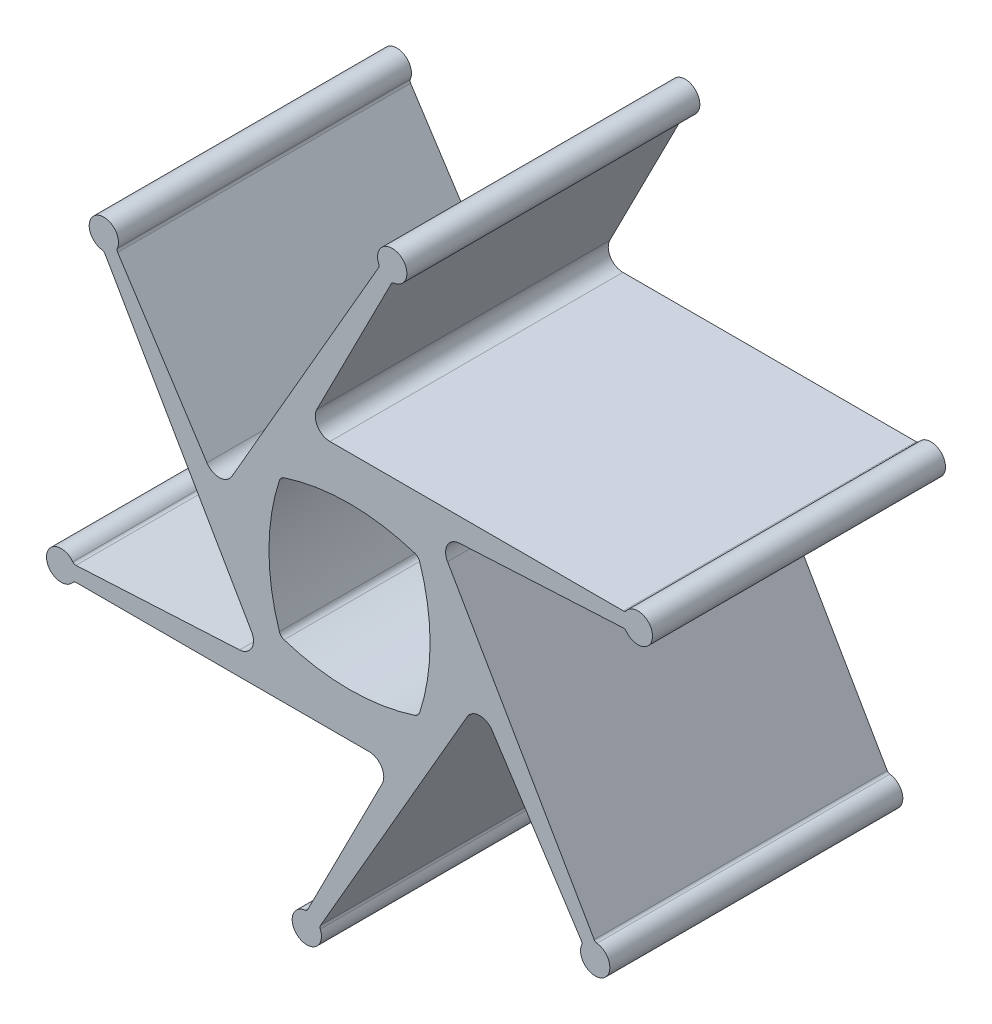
ISO-10303-21;
HEADER;
FILE_DESCRIPTION(('STEP AP214'),'2;1');
FILE_NAME('part.step','',(''),(''),'','','');
FILE_SCHEMA(('AUTOMOTIVE_DESIGN { 1 0 10303 214 1 1 1 1 }'));
ENDSEC;
DATA;
#1=APPLICATION_CONTEXT('core data for automotive mechanical design processes');
#2=APPLICATION_PROTOCOL_DEFINITION('international standard','automotive_design',2000,#1);
#3=PRODUCT_CONTEXT('',#1,'mechanical');
#4=PRODUCT('Part','Part','',(#3));
#5=PRODUCT_RELATED_PRODUCT_CATEGORY('part','',(#4));
#6=PRODUCT_DEFINITION_FORMATION('','',#4);
#7=PRODUCT_DEFINITION_CONTEXT('part definition',#1,'design');
#8=PRODUCT_DEFINITION('design','',#6,#7);
#9=PRODUCT_DEFINITION_SHAPE('','',#8);
#10=(LENGTH_UNIT() NAMED_UNIT(*) SI_UNIT(.MILLI.,.METRE.));
#11=(NAMED_UNIT(*) PLANE_ANGLE_UNIT() SI_UNIT($,.RADIAN.));
#12=(NAMED_UNIT(*) SI_UNIT($,.STERADIAN.) SOLID_ANGLE_UNIT());
#13=UNCERTAINTY_MEASURE_WITH_UNIT(LENGTH_MEASURE(1.E-05),#10,'distance_accuracy_value','');
#14=(GEOMETRIC_REPRESENTATION_CONTEXT(3) GLOBAL_UNCERTAINTY_ASSIGNED_CONTEXT((#13)) GLOBAL_UNIT_ASSIGNED_CONTEXT((#10,
#11,#12)) REPRESENTATION_CONTEXT('',''));
#15=CARTESIAN_POINT('',(0.,0.,0.));
#16=DIRECTION('',(0.,0.,1.));
#17=DIRECTION('',(1.,0.,0.));
#18=AXIS2_PLACEMENT_3D('',#15,#16,#17);
#19=CARTESIAN_POINT('',(-17.9984435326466,7.18319271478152,40.));
#20=DIRECTION('',(0.,0.,1.));
#21=DIRECTION('',(1.,0.,0.));
#22=AXIS2_PLACEMENT_3D('',#19,#20,#21);
#23=PLANE('',#22);
#24=CARTESIAN_POINT('',(-17.9984435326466,7.18319271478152,40.));
#25=DIRECTION('',(0.,0.,-1.));
#26=DIRECTION('',(1.,0.,0.));
#27=AXIS2_PLACEMENT_3D('',#24,#25,#26);
#28=CIRCLE('',#27,2.00000000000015);
#29=CARTESIAN_POINT('',(-16.2663927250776,6.18319271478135,40.));
#30=VERTEX_POINT('',#29);
#31=CARTESIAN_POINT('',(-19.6757846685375,6.09391464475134,40.));
#32=VERTEX_POINT('',#31);
#33=EDGE_CURVE('E449',#30,#32,#28,.T.);
#34=ORIENTED_EDGE('',*,*,#33,.T.);
#35=DIRECTION('',(-0.544639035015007,0.838670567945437,0.));
#36=VECTOR('',#35,1.);
#37=CARTESIAN_POINT('',(-31.8627449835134,24.8601878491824,40.));
#38=LINE('',#37,#36);
#39=CARTESIAN_POINT('',(-31.8627449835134,24.8601878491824,40.));
#40=VERTEX_POINT('',#39);
#41=EDGE_CURVE('E452',#32,#40,#38,.T.);
#42=ORIENTED_EDGE('',*,*,#41,.T.);
#43=CARTESIAN_POINT('',(-31.4434096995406,25.13250736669,40.));
#44=DIRECTION('',(0.,0.,-1.));
#45=DIRECTION('',(1.,0.,0.));
#46=AXIS2_PLACEMENT_3D('',#43,#44,#45);
#47=CIRCLE('',#46,0.500000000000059);
#48=CARTESIAN_POINT('',(-31.9046007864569,25.3256466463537,40.));
#49=VERTEX_POINT('',#48);
#50=EDGE_CURVE('E454',#40,#49,#47,.T.);
#51=ORIENTED_EDGE('',*,*,#50,.T.);
#52=CARTESIAN_POINT('',(-33.7493651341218,26.0982037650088,40.));
#53=DIRECTION('',(0.,0.,1.));
#54=DIRECTION('',(1.,0.,0.));
#55=AXIS2_PLACEMENT_3D('',#52,#53,#54);
#56=CIRCLE('',#55,2.);
#57=CARTESIAN_POINT('',(-33.9885956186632,24.1125631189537,40.));
#58=VERTEX_POINT('',#57);
#59=EDGE_CURVE('E456',#49,#58,#56,.T.);
#60=ORIENTED_EDGE('',*,*,#59,.T.);
#61=CARTESIAN_POINT('',(-34.0484032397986,23.6161529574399,40.));
#62=DIRECTION('',(0.,0.,-1.));
#63=DIRECTION('',(1.,0.,0.));
#64=AXIS2_PLACEMENT_3D('',#61,#62,#63);
#65=CIRCLE('',#64,0.500000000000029);
#66=CARTESIAN_POINT('',(-33.6153905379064,23.8661529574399,40.));
#67=VERTEX_POINT('',#66);
#68=EDGE_CURVE('E458',#58,#67,#65,.T.);
#69=ORIENTED_EDGE('',*,*,#68,.T.);
#70=DIRECTION('',(0.499999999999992,-0.866025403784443,0.));
#71=VECTOR('',#70,1.);
#72=CARTESIAN_POINT('',(-13.5911741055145,-10.8168072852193,40.));
#73=LINE('',#72,#71);
#74=CARTESIAN_POINT('',(-13.5911741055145,-10.8168072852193,40.));
#75=VERTEX_POINT('',#74);
#76=EDGE_CURVE('E460',#67,#75,#73,.T.);
#77=ORIENTED_EDGE('',*,*,#76,.T.);
#78=CARTESIAN_POINT('',(-15.3232249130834,-11.8168072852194,40.));
#79=DIRECTION('',(0.,0.,-1.));
#80=DIRECTION('',(1.,0.,0.));
#81=AXIS2_PLACEMENT_3D('',#78,#79,#80);
#82=CIRCLE('',#81,2.00000000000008);
#83=CARTESIAN_POINT('',(-15.2185530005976,-13.8140663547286,40.));
#84=VERTEX_POINT('',#83);
#85=EDGE_CURVE('E462',#75,#84,#82,.T.);
#86=ORIENTED_EDGE('',*,*,#85,.T.);
#87=DIRECTION('',(-0.998629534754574,-0.0523359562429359,0.));
#88=VECTOR('',#87,1.);
#89=CARTESIAN_POINT('',(-37.5641024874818,-14.9851469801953,40.));
#90=LINE('',#89,#88);
#91=CARTESIAN_POINT('',(-37.5641024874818,-14.9851469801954,40.));
#92=VERTEX_POINT('',#91);
#93=EDGE_CURVE('E464',#84,#92,#90,.T.);
#94=ORIENTED_EDGE('',*,*,#93,.T.);
#95=CARTESIAN_POINT('',(-37.5902704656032,-14.4858322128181,40.));
#96=DIRECTION('',(0.,0.,-1.));
#97=DIRECTION('',(1.,0.,0.));
#98=AXIS2_PLACEMENT_3D('',#95,#96,#97);
#99=CIRCLE('',#98,0.500000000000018);
#100=CARTESIAN_POINT('',(-37.9881295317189,-14.7886657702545,40.));
#101=VERTEX_POINT('',#100);
#102=EDGE_CURVE('E466',#92,#101,#99,.T.);
#103=ORIENTED_EDGE('',*,*,#102,.T.);
#104=CARTESIAN_POINT('',(-39.5795657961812,-16.0000000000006,40.));
#105=DIRECTION('',(0.,0.,1.));
#106=DIRECTION('',(1.,0.,0.));
#107=AXIS2_PLACEMENT_3D('',#104,#105,#106);
#108=CIRCLE('',#107,2.00000000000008);
#109=CARTESIAN_POINT('',(-37.979565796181,-17.2000000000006,40.));
#110=VERTEX_POINT('',#109);
#111=EDGE_CURVE('E468',#101,#110,#108,.T.);
#112=ORIENTED_EDGE('',*,*,#111,.T.);
#113=CARTESIAN_POINT('',(-37.579565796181,-17.5000000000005,40.));
#114=DIRECTION('',(0.,0.,-1.));
#115=DIRECTION('',(1.,0.,0.));
#116=AXIS2_PLACEMENT_3D('',#113,#114,#115);
#117=CIRCLE('',#116,0.500000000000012);
#118=CARTESIAN_POINT('',(-37.5795657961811,-17.0000000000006,40.));
#119=VERTEX_POINT('',#118);
#120=EDGE_CURVE('E470',#110,#119,#117,.T.);
#121=ORIENTED_EDGE('',*,*,#120,.T.);
#122=DIRECTION('',(1.,0.,0.));
#123=VECTOR('',#122,1.);
#124=CARTESIAN_POINT('',(2.46886706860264,-17.0000000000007,40.));
#125=LINE('',#124,#123);
#126=CARTESIAN_POINT('',(2.46886706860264,-17.0000000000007,40.));
#127=VERTEX_POINT('',#126);
#128=EDGE_CURVE('E472',#119,#127,#125,.T.);
#129=ORIENTED_EDGE('',*,*,#128,.T.);
#130=CARTESIAN_POINT('',(2.46886706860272,-19.0000000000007,40.));
#131=DIRECTION('',(0.,0.,-1.));
#132=DIRECTION('',(1.,0.,0.));
#133=AXIS2_PLACEMENT_3D('',#130,#131,#132);
#134=CIRCLE('',#133,2.00000000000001);
#135=CARTESIAN_POINT('',(4.25088011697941,-19.9079809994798,40.));
#136=VERTEX_POINT('',#135);
#137=EDGE_CURVE('E474',#127,#136,#134,.T.);
#138=ORIENTED_EDGE('',*,*,#137,.T.);
#139=DIRECTION('',(-0.45399049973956,-0.891006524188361,0.));
#140=VECTOR('',#139,1.);
#141=CARTESIAN_POINT('',(-5.90770905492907,-39.8453348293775,40.));
#142=LINE('',#141,#140);
#143=CARTESIAN_POINT('',(-5.90770905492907,-39.8453348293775,40.));
#144=VERTEX_POINT('',#143);
#145=EDGE_CURVE('E476',#136,#144,#142,.T.);
#146=ORIENTED_EDGE('',*,*,#145,.T.);
#147=CARTESIAN_POINT('',(-6.35321231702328,-39.6183395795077,40.));
#148=DIRECTION('',(0.,0.,-1.));
#149=DIRECTION('',(1.,0.,0.));
#150=AXIS2_PLACEMENT_3D('',#147,#148,#149);
#151=CIRCLE('',#150,0.500000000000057);
#152=CARTESIAN_POINT('',(-6.28988029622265,-40.1143124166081,40.));
#153=VERTEX_POINT('',#152);
#154=EDGE_CURVE('E478',#144,#153,#151,.T.);
#155=ORIENTED_EDGE('',*,*,#154,.T.);
#156=CARTESIAN_POINT('',(-6.03655221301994,-42.0982037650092,40.));
#157=DIRECTION('',(0.,0.,1.));
#158=DIRECTION('',(1.,0.,0.));
#159=AXIS2_PLACEMENT_3D('',#156,#157,#158);
#160=CIRCLE('',#159,2.00000000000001);
#161=CARTESIAN_POINT('',(-4.19732172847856,-41.3125631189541,40.));
#162=VERTEX_POINT('',#161);
#163=EDGE_CURVE('E480',#153,#162,#160,.T.);
#164=ORIENTED_EDGE('',*,*,#163,.T.);
#165=CARTESIAN_POINT('',(-3.73751410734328,-41.1161529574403,40.));
#166=DIRECTION('',(0.,0.,-1.));
#167=DIRECTION('',(1.,0.,0.));
#168=AXIS2_PLACEMENT_3D('',#165,#166,#167);
#169=CIRCLE('',#168,0.499999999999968);
#170=CARTESIAN_POINT('',(-4.17052680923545,-40.8661529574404,40.));
#171=VERTEX_POINT('',#170);
#172=EDGE_CURVE('E482',#162,#171,#169,.T.);
#173=ORIENTED_EDGE('',*,*,#172,.T.);
#174=DIRECTION('',(0.500000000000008,0.866025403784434,0.));
#175=VECTOR('',#174,1.);
#176=CARTESIAN_POINT('',(15.853689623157,-6.18319271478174,40.));
#177=LINE('',#176,#175);
#178=CARTESIAN_POINT('',(15.853689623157,-6.18319271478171,40.));
#179=VERTEX_POINT('',#178);
#180=EDGE_CURVE('E484',#171,#179,#177,.T.);
#181=ORIENTED_EDGE('',*,*,#180,.T.);
#182=CARTESIAN_POINT('',(17.5857404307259,-7.18319271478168,40.));
#183=DIRECTION('',(0.,0.,-1.));
#184=DIRECTION('',(1.,0.,0.));
#185=AXIS2_PLACEMENT_3D('',#182,#183,#184);
#186=CIRCLE('',#185,2.00000000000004);
#187=CARTESIAN_POINT('',(19.2630815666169,-6.09391464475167,40.));
#188=VERTEX_POINT('',#187);
#189=EDGE_CURVE('E486',#179,#188,#186,.T.);
#190=ORIENTED_EDGE('',*,*,#189,.T.);
#191=DIRECTION('',(0.544639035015,-0.838670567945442,0.));
#192=VECTOR('',#191,1.);
#193=CARTESIAN_POINT('',(31.4500418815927,-24.8601878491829,40.));
#194=LINE('',#193,#192);
#195=CARTESIAN_POINT('',(31.4500418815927,-24.8601878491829,40.));
#196=VERTEX_POINT('',#195);
#197=EDGE_CURVE('E488',#188,#196,#194,.T.);
#198=ORIENTED_EDGE('',*,*,#197,.T.);
#199=CARTESIAN_POINT('',(31.03070659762,-25.1325073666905,40.));
#200=DIRECTION('',(0.,0.,-1.));
#201=DIRECTION('',(1.,0.,0.));
#202=AXIS2_PLACEMENT_3D('',#199,#200,#201);
#203=CIRCLE('',#202,0.499999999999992);
#204=CARTESIAN_POINT('',(31.4918976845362,-25.3256466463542,40.));
#205=VERTEX_POINT('',#204);
#206=EDGE_CURVE('E490',#196,#205,#203,.T.);
#207=ORIENTED_EDGE('',*,*,#206,.T.);
#208=CARTESIAN_POINT('',(33.336662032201,-26.0982037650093,40.));
#209=DIRECTION('',(0.,0.,1.));
#210=DIRECTION('',(1.,0.,0.));
#211=AXIS2_PLACEMENT_3D('',#208,#209,#210);
#212=CIRCLE('',#211,2.00000000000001);
#213=CARTESIAN_POINT('',(33.5758925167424,-24.1125631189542,40.));
#214=VERTEX_POINT('',#213);
#215=EDGE_CURVE('E492',#205,#214,#212,.T.);
#216=ORIENTED_EDGE('',*,*,#215,.T.);
#217=CARTESIAN_POINT('',(33.635700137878,-23.6161529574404,40.));
#218=DIRECTION('',(0.,0.,-1.));
#219=DIRECTION('',(1.,0.,0.));
#220=AXIS2_PLACEMENT_3D('',#217,#218,#219);
#221=CIRCLE('',#220,0.50000000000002);
#222=CARTESIAN_POINT('',(33.2026874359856,-23.8661529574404,40.));
#223=VERTEX_POINT('',#222);
#224=EDGE_CURVE('E494',#214,#223,#221,.T.);
#225=ORIENTED_EDGE('',*,*,#224,.T.);
#226=DIRECTION('',(-0.499999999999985,0.866025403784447,0.));
#227=VECTOR('',#226,1.);
#228=CARTESIAN_POINT('',(13.178471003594,10.8168072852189,40.));
#229=LINE('',#228,#227);
#230=CARTESIAN_POINT('',(13.1784710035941,10.816807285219,40.));
#231=VERTEX_POINT('',#230);
#232=EDGE_CURVE('E496',#223,#231,#229,.T.);
#233=ORIENTED_EDGE('',*,*,#232,.T.);
#234=CARTESIAN_POINT('',(14.9105218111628,11.8168072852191,40.));
#235=DIRECTION('',(0.,0.,-1.));
#236=DIRECTION('',(1.,0.,0.));
#237=AXIS2_PLACEMENT_3D('',#234,#235,#236);
#238=CIRCLE('',#237,1.99999999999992);
#239=CARTESIAN_POINT('',(14.805849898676,13.814066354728,40.));
#240=VERTEX_POINT('',#239);
#241=EDGE_CURVE('E498',#231,#240,#238,.T.);
#242=ORIENTED_EDGE('',*,*,#241,.T.);
#243=DIRECTION('',(0.998629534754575,0.0523359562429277,0.));
#244=VECTOR('',#243,1.);
#245=CARTESIAN_POINT('',(37.1513993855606,14.9851469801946,40.));
#246=LINE('',#245,#244);
#247=CARTESIAN_POINT('',(37.1513993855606,14.985146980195,40.));
#248=VERTEX_POINT('',#247);
#249=EDGE_CURVE('E500',#240,#248,#246,.T.);
#250=ORIENTED_EDGE('',*,*,#249,.T.);
#251=CARTESIAN_POINT('',(37.177567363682,14.4858322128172,40.));
#252=DIRECTION('',(0.,0.,-1.));
#253=DIRECTION('',(1.,0.,0.));
#254=AXIS2_PLACEMENT_3D('',#251,#252,#253);
#255=CIRCLE('',#254,0.500000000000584);
#256=CARTESIAN_POINT('',(37.5754264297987,14.788665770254,40.));
#257=VERTEX_POINT('',#256);
#258=EDGE_CURVE('E502',#248,#257,#255,.T.);
#259=ORIENTED_EDGE('',*,*,#258,.T.);
#260=CARTESIAN_POINT('',(39.1668626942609,16.0000000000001,40.));
#261=DIRECTION('',(0.,0.,1.));
#262=DIRECTION('',(1.,0.,0.));
#263=AXIS2_PLACEMENT_3D('',#260,#261,#262);
#264=CIRCLE('',#263,2.00000000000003);
#265=CARTESIAN_POINT('',(37.5668626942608,17.2000000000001,40.));
#266=VERTEX_POINT('',#265);
#267=EDGE_CURVE('E504',#257,#266,#264,.T.);
#268=ORIENTED_EDGE('',*,*,#267,.T.);
#269=CARTESIAN_POINT('',(37.1668626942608,17.5000000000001,40.));
#270=DIRECTION('',(0.,0.,-1.));
#271=DIRECTION('',(1.,0.,0.));
#272=AXIS2_PLACEMENT_3D('',#269,#270,#271);
#273=CIRCLE('',#272,0.500000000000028);
#274=CARTESIAN_POINT('',(37.1668626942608,17.0000000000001,40.));
#275=VERTEX_POINT('',#274);
#276=EDGE_CURVE('E506',#266,#275,#273,.T.);
#277=ORIENTED_EDGE('',*,*,#276,.T.);
#278=DIRECTION('',(-1.,0.,0.));
#279=VECTOR('',#278,1.);
#280=CARTESIAN_POINT('',(-2.8815701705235,17.0000000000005,40.));
#281=LINE('',#280,#279);
#282=CARTESIAN_POINT('',(-2.8815701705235,17.0000000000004,40.));
#283=VERTEX_POINT('',#282);
#284=EDGE_CURVE('E508',#275,#283,#281,.T.);
#285=ORIENTED_EDGE('',*,*,#284,.T.);
#286=CARTESIAN_POINT('',(-2.88157017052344,19.0000000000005,40.));
#287=DIRECTION('',(0.,0.,-1.));
#288=DIRECTION('',(1.,0.,0.));
#289=AXIS2_PLACEMENT_3D('',#286,#287,#288);
#290=CIRCLE('',#289,2.00000000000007);
#291=CARTESIAN_POINT('',(-4.66358321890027,19.9079809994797,40.));
#292=VERTEX_POINT('',#291);
#293=EDGE_CURVE('E510',#283,#292,#290,.T.);
#294=ORIENTED_EDGE('',*,*,#293,.T.);
#295=DIRECTION('',(0.453990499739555,0.891006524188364,0.));
#296=VECTOR('',#295,1.);
#297=CARTESIAN_POINT('',(5.49500595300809,39.8453348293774,40.));
#298=LINE('',#297,#296);
#299=CARTESIAN_POINT('',(5.49500595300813,39.8453348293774,40.));
#300=VERTEX_POINT('',#299);
#301=EDGE_CURVE('E512',#292,#300,#298,.T.);
#302=ORIENTED_EDGE('',*,*,#301,.T.);
#303=CARTESIAN_POINT('',(5.94050921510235,39.6183395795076,40.));
#304=DIRECTION('',(0.,0.,-1.));
#305=DIRECTION('',(1.,0.,0.));
#306=AXIS2_PLACEMENT_3D('',#303,#304,#305);
#307=CIRCLE('',#306,0.500000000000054);
#308=CARTESIAN_POINT('',(5.87717719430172,40.1143124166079,40.));
#309=VERTEX_POINT('',#308);
#310=EDGE_CURVE('E514',#300,#309,#307,.T.);
#311=ORIENTED_EDGE('',*,*,#310,.T.);
#312=CARTESIAN_POINT('',(5.62384911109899,42.0982037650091,40.));
#313=DIRECTION('',(0.,0.,1.));
#314=DIRECTION('',(1.,0.,0.));
#315=AXIS2_PLACEMENT_3D('',#312,#313,#314);
#316=CIRCLE('',#315,2.00000000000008);
#317=CARTESIAN_POINT('',(3.78461862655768,41.3125631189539,40.));
#318=VERTEX_POINT('',#317);
#319=EDGE_CURVE('E516',#309,#318,#316,.T.);
#320=ORIENTED_EDGE('',*,*,#319,.T.);
#321=CARTESIAN_POINT('',(3.32481100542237,41.1161529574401,40.));
#322=DIRECTION('',(0.,0.,-1.));
#323=DIRECTION('',(1.,0.,0.));
#324=AXIS2_PLACEMENT_3D('',#321,#322,#323);
#325=CIRCLE('',#324,0.499999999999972);
#326=CARTESIAN_POINT('',(3.75782370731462,40.8661529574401,40.));
#327=VERTEX_POINT('',#326);
#328=EDGE_CURVE('E518',#318,#327,#325,.T.);
#329=ORIENTED_EDGE('',*,*,#328,.T.);
#330=DIRECTION('',(-0.500000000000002,-0.866025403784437,0.));
#331=VECTOR('',#330,1.);
#332=CARTESIAN_POINT('',(-16.2663927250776,6.18319271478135,40.));
#333=LINE('',#332,#331);
#334=EDGE_CURVE('E520',#327,#30,#333,.T.);
#335=ORIENTED_EDGE('',*,*,#334,.T.);
#336=EDGE_LOOP('',(#34,#42,#51,#60,#69,#77,#86,#94,#103,#112,#121,#129,#138,#146,#155,#164,#173,
#181,#190,#198,#207,#216,#225,#233,#242,#250,#259,#268,#277,#285,#294,#302,#311,#320,#329,#335));
#337=FACE_BOUND('',#336,.T.);
#338=CARTESIAN_POINT('',(-8.83179797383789,-8.62544642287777,40.));
#339=DIRECTION('',(0.,0.,1.));
#340=DIRECTION('',(1.,0.,0.));
#341=AXIS2_PLACEMENT_3D('',#338,#339,#340);
#342=CIRCLE('',#341,0.999999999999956);
#343=CARTESIAN_POINT('',(-9.78226451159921,-8.93627332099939,40.));
#344=VERTEX_POINT('',#343);
#345=CARTESIAN_POINT('',(-9.14262487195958,-9.57591296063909,40.));
#346=VERTEX_POINT('',#345);
#347=EDGE_CURVE('E351',#344,#346,#342,.T.);
#348=ORIENTED_EDGE('',*,*,#347,.F.);
#349=CARTESIAN_POINT('',(17.54364844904,0.,40.));
#350=DIRECTION('',(0.,0.,1.));
#351=DIRECTION('',(1.,0.,0.));
#352=AXIS2_PLACEMENT_3D('',#349,#350,#351);
#353=CIRCLE('',#352,28.7500000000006);
#354=CARTESIAN_POINT('',(-9.78226451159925,8.93627332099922,40.));
#355=VERTEX_POINT('',#354);
#356=EDGE_CURVE('E328',#355,#344,#353,.T.);
#357=ORIENTED_EDGE('',*,*,#356,.F.);
#358=CARTESIAN_POINT('',(-8.83179797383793,8.6254464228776,40.));
#359=DIRECTION('',(0.,0.,1.));
#360=DIRECTION('',(1.,0.,0.));
#361=AXIS2_PLACEMENT_3D('',#358,#359,#360);
#362=CIRCLE('',#361,0.999999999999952);
#363=CARTESIAN_POINT('',(-9.14262487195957,9.57591296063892,40.));
#364=VERTEX_POINT('',#363);
#365=EDGE_CURVE('E363',#364,#355,#362,.T.);
#366=ORIENTED_EDGE('',*,*,#365,.F.);
#367=CARTESIAN_POINT('',(-0.206351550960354,-17.7500000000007,40.));
#368=DIRECTION('',(0.,0.,1.));
#369=DIRECTION('',(1.,0.,0.));
#370=AXIS2_PLACEMENT_3D('',#367,#368,#369);
#371=CIRCLE('',#370,28.7500000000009);
#372=CARTESIAN_POINT('',(8.72992177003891,9.57591296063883,40.));
#373=VERTEX_POINT('',#372);
#374=EDGE_CURVE('E361',#373,#364,#371,.T.);
#375=ORIENTED_EDGE('',*,*,#374,.F.);
#376=CARTESIAN_POINT('',(8.41909487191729,8.62544642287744,40.));
#377=DIRECTION('',(0.,0.,1.));
#378=DIRECTION('',(1.,0.,0.));
#379=AXIS2_PLACEMENT_3D('',#376,#377,#378);
#380=CIRCLE('',#379,0.999999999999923);
#381=CARTESIAN_POINT('',(9.36956140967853,8.93627332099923,40.));
#382=VERTEX_POINT('',#381);
#383=EDGE_CURVE('E359',#382,#373,#380,.T.);
#384=ORIENTED_EDGE('',*,*,#383,.F.);
#385=CARTESIAN_POINT('',(-17.9563515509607,0.,40.));
#386=DIRECTION('',(0.,0.,1.));
#387=DIRECTION('',(1.,0.,0.));
#388=AXIS2_PLACEMENT_3D('',#385,#386,#387);
#389=CIRCLE('',#388,28.7500000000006);
#390=CARTESIAN_POINT('',(9.36956140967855,-8.93627332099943,40.));
#391=VERTEX_POINT('',#390);
#392=EDGE_CURVE('E357',#391,#382,#389,.T.);
#393=ORIENTED_EDGE('',*,*,#392,.F.);
#394=CARTESIAN_POINT('',(8.41909487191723,-8.62544642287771,40.));
#395=DIRECTION('',(0.,0.,1.));
#396=DIRECTION('',(1.,0.,0.));
#397=AXIS2_PLACEMENT_3D('',#394,#395,#396);
#398=CIRCLE('',#397,1.00000000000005);
#399=CARTESIAN_POINT('',(8.72992177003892,-9.57591296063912,40.));
#400=VERTEX_POINT('',#399);
#401=EDGE_CURVE('E355',#400,#391,#398,.T.);
#402=ORIENTED_EDGE('',*,*,#401,.F.);
#403=CARTESIAN_POINT('',(-0.206351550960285,17.7500000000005,40.));
#404=DIRECTION('',(0.,0.,1.));
#405=DIRECTION('',(1.,0.,0.));
#406=AXIS2_PLACEMENT_3D('',#403,#404,#405);
#407=CIRCLE('',#406,28.7500000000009);
#408=EDGE_CURVE('E353',#346,#400,#407,.T.);
#409=ORIENTED_EDGE('',*,*,#408,.F.);
#410=EDGE_LOOP('',(#348,#357,#366,#375,#384,#393,#402,#409));
#411=FACE_BOUND('',#410,.T.);
#412=ADVANCED_FACE('F32',(#337,#411),#23,.T.);
#413=CARTESIAN_POINT('',(-17.9984435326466,7.18319271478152,0.));
#414=DIRECTION('',(0.,0.,1.));
#415=DIRECTION('',(1.,0.,0.));
#416=AXIS2_PLACEMENT_3D('',#413,#414,#415);
#417=PLANE('',#416);
#418=CARTESIAN_POINT('',(-17.9984435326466,7.18319271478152,0.));
#419=DIRECTION('',(0.,0.,-1.));
#420=DIRECTION('',(1.,0.,0.));
#421=AXIS2_PLACEMENT_3D('',#418,#419,#420);
#422=CIRCLE('',#421,2.00000000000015);
#423=CARTESIAN_POINT('',(-16.2663927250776,6.18319271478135,0.));
#424=VERTEX_POINT('',#423);
#425=CARTESIAN_POINT('',(-19.6757846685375,6.09391464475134,0.));
#426=VERTEX_POINT('',#425);
#427=EDGE_CURVE('E329',#424,#426,#422,.T.);
#428=ORIENTED_EDGE('',*,*,#427,.F.);
#429=DIRECTION('',(-0.500000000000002,-0.866025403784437,0.));
#430=VECTOR('',#429,1.);
#431=CARTESIAN_POINT('',(-16.2663927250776,6.18319271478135,0.));
#432=LINE('',#431,#430);
#433=CARTESIAN_POINT('',(3.75782370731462,40.8661529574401,0.));
#434=VERTEX_POINT('',#433);
#435=EDGE_CURVE('E447',#434,#424,#432,.T.);
#436=ORIENTED_EDGE('',*,*,#435,.F.);
#437=CARTESIAN_POINT('',(3.32481100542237,41.1161529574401,0.));
#438=DIRECTION('',(0.,0.,-1.));
#439=DIRECTION('',(1.,0.,0.));
#440=AXIS2_PLACEMENT_3D('',#437,#438,#439);
#441=CIRCLE('',#440,0.499999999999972);
#442=CARTESIAN_POINT('',(3.78461862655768,41.3125631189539,0.));
#443=VERTEX_POINT('',#442);
#444=EDGE_CURVE('E445',#443,#434,#441,.T.);
#445=ORIENTED_EDGE('',*,*,#444,.F.);
#446=CARTESIAN_POINT('',(5.62384911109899,42.0982037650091,0.));
#447=DIRECTION('',(0.,0.,1.));
#448=DIRECTION('',(1.,0.,0.));
#449=AXIS2_PLACEMENT_3D('',#446,#447,#448);
#450=CIRCLE('',#449,2.00000000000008);
#451=CARTESIAN_POINT('',(5.87717719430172,40.1143124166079,0.));
#452=VERTEX_POINT('',#451);
#453=EDGE_CURVE('E443',#452,#443,#450,.T.);
#454=ORIENTED_EDGE('',*,*,#453,.F.);
#455=CARTESIAN_POINT('',(5.94050921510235,39.6183395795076,0.));
#456=DIRECTION('',(0.,0.,-1.));
#457=DIRECTION('',(1.,0.,0.));
#458=AXIS2_PLACEMENT_3D('',#455,#456,#457);
#459=CIRCLE('',#458,0.500000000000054);
#460=CARTESIAN_POINT('',(5.49500595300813,39.8453348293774,0.));
#461=VERTEX_POINT('',#460);
#462=EDGE_CURVE('E441',#461,#452,#459,.T.);
#463=ORIENTED_EDGE('',*,*,#462,.F.);
#464=DIRECTION('',(0.453990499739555,0.891006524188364,0.));
#465=VECTOR('',#464,1.);
#466=CARTESIAN_POINT('',(5.49500595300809,39.8453348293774,0.));
#467=LINE('',#466,#465);
#468=CARTESIAN_POINT('',(-4.66358321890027,19.9079809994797,0.));
#469=VERTEX_POINT('',#468);
#470=EDGE_CURVE('E439',#469,#461,#467,.T.);
#471=ORIENTED_EDGE('',*,*,#470,.F.);
#472=CARTESIAN_POINT('',(-2.88157017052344,19.0000000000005,0.));
#473=DIRECTION('',(0.,0.,-1.));
#474=DIRECTION('',(1.,0.,0.));
#475=AXIS2_PLACEMENT_3D('',#472,#473,#474);
#476=CIRCLE('',#475,2.00000000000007);
#477=CARTESIAN_POINT('',(-2.8815701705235,17.0000000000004,0.));
#478=VERTEX_POINT('',#477);
#479=EDGE_CURVE('E437',#478,#469,#476,.T.);
#480=ORIENTED_EDGE('',*,*,#479,.F.);
#481=DIRECTION('',(-1.,0.,0.));
#482=VECTOR('',#481,1.);
#483=CARTESIAN_POINT('',(-2.8815701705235,17.0000000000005,0.));
#484=LINE('',#483,#482);
#485=CARTESIAN_POINT('',(37.1668626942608,17.0000000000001,0.));
#486=VERTEX_POINT('',#485);
#487=EDGE_CURVE('E435',#486,#478,#484,.T.);
#488=ORIENTED_EDGE('',*,*,#487,.F.);
#489=CARTESIAN_POINT('',(37.1668626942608,17.5000000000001,0.));
#490=DIRECTION('',(0.,0.,-1.));
#491=DIRECTION('',(1.,0.,0.));
#492=AXIS2_PLACEMENT_3D('',#489,#490,#491);
#493=CIRCLE('',#492,0.500000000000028);
#494=CARTESIAN_POINT('',(37.5668626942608,17.2000000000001,0.));
#495=VERTEX_POINT('',#494);
#496=EDGE_CURVE('E433',#495,#486,#493,.T.);
#497=ORIENTED_EDGE('',*,*,#496,.F.);
#498=CARTESIAN_POINT('',(39.1668626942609,16.0000000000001,0.));
#499=DIRECTION('',(0.,0.,1.));
#500=DIRECTION('',(1.,0.,0.));
#501=AXIS2_PLACEMENT_3D('',#498,#499,#500);
#502=CIRCLE('',#501,2.00000000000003);
#503=CARTESIAN_POINT('',(37.5754264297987,14.788665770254,0.));
#504=VERTEX_POINT('',#503);
#505=EDGE_CURVE('E431',#504,#495,#502,.T.);
#506=ORIENTED_EDGE('',*,*,#505,.F.);
#507=CARTESIAN_POINT('',(37.177567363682,14.4858322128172,0.));
#508=DIRECTION('',(0.,0.,-1.));
#509=DIRECTION('',(1.,0.,0.));
#510=AXIS2_PLACEMENT_3D('',#507,#508,#509);
#511=CIRCLE('',#510,0.500000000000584);
#512=CARTESIAN_POINT('',(37.1513993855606,14.985146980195,0.));
#513=VERTEX_POINT('',#512);
#514=EDGE_CURVE('E429',#513,#504,#511,.T.);
#515=ORIENTED_EDGE('',*,*,#514,.F.);
#516=DIRECTION('',(0.998629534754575,0.0523359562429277,0.));
#517=VECTOR('',#516,1.);
#518=CARTESIAN_POINT('',(37.1513993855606,14.9851469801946,0.));
#519=LINE('',#518,#517);
#520=CARTESIAN_POINT('',(14.805849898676,13.814066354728,0.));
#521=VERTEX_POINT('',#520);
#522=EDGE_CURVE('E427',#521,#513,#519,.T.);
#523=ORIENTED_EDGE('',*,*,#522,.F.);
#524=CARTESIAN_POINT('',(14.9105218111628,11.8168072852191,0.));
#525=DIRECTION('',(0.,0.,-1.));
#526=DIRECTION('',(1.,0.,0.));
#527=AXIS2_PLACEMENT_3D('',#524,#525,#526);
#528=CIRCLE('',#527,1.99999999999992);
#529=CARTESIAN_POINT('',(13.1784710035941,10.816807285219,0.));
#530=VERTEX_POINT('',#529);
#531=EDGE_CURVE('E425',#530,#521,#528,.T.);
#532=ORIENTED_EDGE('',*,*,#531,.F.);
#533=DIRECTION('',(-0.499999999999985,0.866025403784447,0.));
#534=VECTOR('',#533,1.);
#535=CARTESIAN_POINT('',(13.178471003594,10.8168072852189,0.));
#536=LINE('',#535,#534);
#537=CARTESIAN_POINT('',(33.2026874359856,-23.8661529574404,0.));
#538=VERTEX_POINT('',#537);
#539=EDGE_CURVE('E423',#538,#530,#536,.T.);
#540=ORIENTED_EDGE('',*,*,#539,.F.);
#541=CARTESIAN_POINT('',(33.635700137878,-23.6161529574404,0.));
#542=DIRECTION('',(0.,0.,-1.));
#543=DIRECTION('',(1.,0.,0.));
#544=AXIS2_PLACEMENT_3D('',#541,#542,#543);
#545=CIRCLE('',#544,0.50000000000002);
#546=CARTESIAN_POINT('',(33.5758925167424,-24.1125631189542,0.));
#547=VERTEX_POINT('',#546);
#548=EDGE_CURVE('E421',#547,#538,#545,.T.);
#549=ORIENTED_EDGE('',*,*,#548,.F.);
#550=CARTESIAN_POINT('',(33.336662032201,-26.0982037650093,0.));
#551=DIRECTION('',(0.,0.,1.));
#552=DIRECTION('',(1.,0.,0.));
#553=AXIS2_PLACEMENT_3D('',#550,#551,#552);
#554=CIRCLE('',#553,2.00000000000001);
#555=CARTESIAN_POINT('',(31.4918976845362,-25.3256466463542,0.));
#556=VERTEX_POINT('',#555);
#557=EDGE_CURVE('E419',#556,#547,#554,.T.);
#558=ORIENTED_EDGE('',*,*,#557,.F.);
#559=CARTESIAN_POINT('',(31.03070659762,-25.1325073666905,0.));
#560=DIRECTION('',(0.,0.,-1.));
#561=DIRECTION('',(1.,0.,0.));
#562=AXIS2_PLACEMENT_3D('',#559,#560,#561);
#563=CIRCLE('',#562,0.499999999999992);
#564=CARTESIAN_POINT('',(31.4500418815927,-24.8601878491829,0.));
#565=VERTEX_POINT('',#564);
#566=EDGE_CURVE('E417',#565,#556,#563,.T.);
#567=ORIENTED_EDGE('',*,*,#566,.F.);
#568=DIRECTION('',(0.544639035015,-0.838670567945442,0.));
#569=VECTOR('',#568,1.);
#570=CARTESIAN_POINT('',(31.4500418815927,-24.8601878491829,0.));
#571=LINE('',#570,#569);
#572=CARTESIAN_POINT('',(19.2630815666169,-6.09391464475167,0.));
#573=VERTEX_POINT('',#572);
#574=EDGE_CURVE('E415',#573,#565,#571,.T.);
#575=ORIENTED_EDGE('',*,*,#574,.F.);
#576=CARTESIAN_POINT('',(17.5857404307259,-7.18319271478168,0.));
#577=DIRECTION('',(0.,0.,-1.));
#578=DIRECTION('',(1.,0.,0.));
#579=AXIS2_PLACEMENT_3D('',#576,#577,#578);
#580=CIRCLE('',#579,2.00000000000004);
#581=CARTESIAN_POINT('',(15.853689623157,-6.18319271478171,0.));
#582=VERTEX_POINT('',#581);
#583=EDGE_CURVE('E413',#582,#573,#580,.T.);
#584=ORIENTED_EDGE('',*,*,#583,.F.);
#585=DIRECTION('',(0.500000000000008,0.866025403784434,0.));
#586=VECTOR('',#585,1.);
#587=CARTESIAN_POINT('',(15.853689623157,-6.18319271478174,0.));
#588=LINE('',#587,#586);
#589=CARTESIAN_POINT('',(-4.17052680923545,-40.8661529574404,0.));
#590=VERTEX_POINT('',#589);
#591=EDGE_CURVE('E411',#590,#582,#588,.T.);
#592=ORIENTED_EDGE('',*,*,#591,.F.);
#593=CARTESIAN_POINT('',(-3.73751410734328,-41.1161529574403,0.));
#594=DIRECTION('',(0.,0.,-1.));
#595=DIRECTION('',(1.,0.,0.));
#596=AXIS2_PLACEMENT_3D('',#593,#594,#595);
#597=CIRCLE('',#596,0.499999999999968);
#598=CARTESIAN_POINT('',(-4.19732172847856,-41.3125631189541,0.));
#599=VERTEX_POINT('',#598);
#600=EDGE_CURVE('E409',#599,#590,#597,.T.);
#601=ORIENTED_EDGE('',*,*,#600,.F.);
#602=CARTESIAN_POINT('',(-6.03655221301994,-42.0982037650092,0.));
#603=DIRECTION('',(0.,0.,1.));
#604=DIRECTION('',(1.,0.,0.));
#605=AXIS2_PLACEMENT_3D('',#602,#603,#604);
#606=CIRCLE('',#605,2.00000000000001);
#607=CARTESIAN_POINT('',(-6.28988029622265,-40.1143124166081,0.));
#608=VERTEX_POINT('',#607);
#609=EDGE_CURVE('E407',#608,#599,#606,.T.);
#610=ORIENTED_EDGE('',*,*,#609,.F.);
#611=CARTESIAN_POINT('',(-6.35321231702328,-39.6183395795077,0.));
#612=DIRECTION('',(0.,0.,-1.));
#613=DIRECTION('',(1.,0.,0.));
#614=AXIS2_PLACEMENT_3D('',#611,#612,#613);
#615=CIRCLE('',#614,0.500000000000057);
#616=CARTESIAN_POINT('',(-5.90770905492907,-39.8453348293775,0.));
#617=VERTEX_POINT('',#616);
#618=EDGE_CURVE('E405',#617,#608,#615,.T.);
#619=ORIENTED_EDGE('',*,*,#618,.F.);
#620=DIRECTION('',(-0.45399049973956,-0.891006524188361,0.));
#621=VECTOR('',#620,1.);
#622=CARTESIAN_POINT('',(-5.90770905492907,-39.8453348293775,0.));
#623=LINE('',#622,#621);
#624=CARTESIAN_POINT('',(4.25088011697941,-19.9079809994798,0.));
#625=VERTEX_POINT('',#624);
#626=EDGE_CURVE('E403',#625,#617,#623,.T.);
#627=ORIENTED_EDGE('',*,*,#626,.F.);
#628=CARTESIAN_POINT('',(2.46886706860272,-19.0000000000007,0.));
#629=DIRECTION('',(0.,0.,-1.));
#630=DIRECTION('',(1.,0.,0.));
#631=AXIS2_PLACEMENT_3D('',#628,#629,#630);
#632=CIRCLE('',#631,2.00000000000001);
#633=CARTESIAN_POINT('',(2.46886706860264,-17.0000000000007,0.));
#634=VERTEX_POINT('',#633);
#635=EDGE_CURVE('E401',#634,#625,#632,.T.);
#636=ORIENTED_EDGE('',*,*,#635,.F.);
#637=DIRECTION('',(1.,0.,0.));
#638=VECTOR('',#637,1.);
#639=CARTESIAN_POINT('',(2.46886706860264,-17.0000000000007,0.));
#640=LINE('',#639,#638);
#641=CARTESIAN_POINT('',(-37.5795657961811,-17.0000000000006,0.));
#642=VERTEX_POINT('',#641);
#643=EDGE_CURVE('E399',#642,#634,#640,.T.);
#644=ORIENTED_EDGE('',*,*,#643,.F.);
#645=CARTESIAN_POINT('',(-37.579565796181,-17.5000000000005,0.));
#646=DIRECTION('',(0.,0.,-1.));
#647=DIRECTION('',(1.,0.,0.));
#648=AXIS2_PLACEMENT_3D('',#645,#646,#647);
#649=CIRCLE('',#648,0.500000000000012);
#650=CARTESIAN_POINT('',(-37.979565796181,-17.2000000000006,0.));
#651=VERTEX_POINT('',#650);
#652=EDGE_CURVE('E397',#651,#642,#649,.T.);
#653=ORIENTED_EDGE('',*,*,#652,.F.);
#654=CARTESIAN_POINT('',(-39.5795657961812,-16.0000000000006,0.));
#655=DIRECTION('',(0.,0.,1.));
#656=DIRECTION('',(1.,0.,0.));
#657=AXIS2_PLACEMENT_3D('',#654,#655,#656);
#658=CIRCLE('',#657,2.00000000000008);
#659=CARTESIAN_POINT('',(-37.9881295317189,-14.7886657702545,0.));
#660=VERTEX_POINT('',#659);
#661=EDGE_CURVE('E395',#660,#651,#658,.T.);
#662=ORIENTED_EDGE('',*,*,#661,.F.);
#663=CARTESIAN_POINT('',(-37.5902704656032,-14.4858322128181,0.));
#664=DIRECTION('',(0.,0.,-1.));
#665=DIRECTION('',(1.,0.,0.));
#666=AXIS2_PLACEMENT_3D('',#663,#664,#665);
#667=CIRCLE('',#666,0.500000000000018);
#668=CARTESIAN_POINT('',(-37.5641024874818,-14.9851469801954,0.));
#669=VERTEX_POINT('',#668);
#670=EDGE_CURVE('E393',#669,#660,#667,.T.);
#671=ORIENTED_EDGE('',*,*,#670,.F.);
#672=DIRECTION('',(-0.998629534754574,-0.0523359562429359,0.));
#673=VECTOR('',#672,1.);
#674=CARTESIAN_POINT('',(-37.5641024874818,-14.9851469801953,0.));
#675=LINE('',#674,#673);
#676=CARTESIAN_POINT('',(-15.2185530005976,-13.8140663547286,0.));
#677=VERTEX_POINT('',#676);
#678=EDGE_CURVE('E391',#677,#669,#675,.T.);
#679=ORIENTED_EDGE('',*,*,#678,.F.);
#680=CARTESIAN_POINT('',(-15.3232249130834,-11.8168072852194,0.));
#681=DIRECTION('',(0.,0.,-1.));
#682=DIRECTION('',(1.,0.,0.));
#683=AXIS2_PLACEMENT_3D('',#680,#681,#682);
#684=CIRCLE('',#683,2.00000000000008);
#685=CARTESIAN_POINT('',(-13.5911741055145,-10.8168072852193,0.));
#686=VERTEX_POINT('',#685);
#687=EDGE_CURVE('E389',#686,#677,#684,.T.);
#688=ORIENTED_EDGE('',*,*,#687,.F.);
#689=DIRECTION('',(0.499999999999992,-0.866025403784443,0.));
#690=VECTOR('',#689,1.);
#691=CARTESIAN_POINT('',(-13.5911741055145,-10.8168072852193,0.));
#692=LINE('',#691,#690);
#693=CARTESIAN_POINT('',(-33.6153905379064,23.8661529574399,0.));
#694=VERTEX_POINT('',#693);
#695=EDGE_CURVE('E387',#694,#686,#692,.T.);
#696=ORIENTED_EDGE('',*,*,#695,.F.);
#697=CARTESIAN_POINT('',(-34.0484032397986,23.6161529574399,0.));
#698=DIRECTION('',(0.,0.,-1.));
#699=DIRECTION('',(1.,0.,0.));
#700=AXIS2_PLACEMENT_3D('',#697,#698,#699);
#701=CIRCLE('',#700,0.500000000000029);
#702=CARTESIAN_POINT('',(-33.9885956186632,24.1125631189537,0.));
#703=VERTEX_POINT('',#702);
#704=EDGE_CURVE('E385',#703,#694,#701,.T.);
#705=ORIENTED_EDGE('',*,*,#704,.F.);
#706=CARTESIAN_POINT('',(-33.7493651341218,26.0982037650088,0.));
#707=DIRECTION('',(0.,0.,1.));
#708=DIRECTION('',(1.,0.,0.));
#709=AXIS2_PLACEMENT_3D('',#706,#707,#708);
#710=CIRCLE('',#709,2.);
#711=CARTESIAN_POINT('',(-31.9046007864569,25.3256466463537,0.));
#712=VERTEX_POINT('',#711);
#713=EDGE_CURVE('E383',#712,#703,#710,.T.);
#714=ORIENTED_EDGE('',*,*,#713,.F.);
#715=CARTESIAN_POINT('',(-31.4434096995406,25.13250736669,0.));
#716=DIRECTION('',(0.,0.,-1.));
#717=DIRECTION('',(1.,0.,0.));
#718=AXIS2_PLACEMENT_3D('',#715,#716,#717);
#719=CIRCLE('',#718,0.500000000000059);
#720=CARTESIAN_POINT('',(-31.8627449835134,24.8601878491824,0.));
#721=VERTEX_POINT('',#720);
#722=EDGE_CURVE('E381',#721,#712,#719,.T.);
#723=ORIENTED_EDGE('',*,*,#722,.F.);
#724=DIRECTION('',(-0.544639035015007,0.838670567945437,0.));
#725=VECTOR('',#724,1.);
#726=CARTESIAN_POINT('',(-31.8627449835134,24.8601878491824,0.));
#727=LINE('',#726,#725);
#728=EDGE_CURVE('E379',#426,#721,#727,.T.);
#729=ORIENTED_EDGE('',*,*,#728,.F.);
#730=EDGE_LOOP('',(#428,#436,#445,#454,#463,#471,#480,#488,#497,#506,#515,#523,#532,#540,#549,
#558,#567,#575,#584,#592,#601,#610,#619,#627,#636,#644,#653,#662,#671,#679,#688,#696,#705,#714,
#723,#729));
#731=FACE_BOUND('',#730,.T.);
#732=CARTESIAN_POINT('',(17.54364844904,0.,0.));
#733=DIRECTION('',(0.,0.,1.));
#734=DIRECTION('',(1.,0.,0.));
#735=AXIS2_PLACEMENT_3D('',#732,#733,#734);
#736=CIRCLE('',#735,28.7500000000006);
#737=CARTESIAN_POINT('',(-9.78226451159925,8.93627332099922,0.));
#738=VERTEX_POINT('',#737);
#739=CARTESIAN_POINT('',(-9.78226451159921,-8.93627332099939,0.));
#740=VERTEX_POINT('',#739);
#741=EDGE_CURVE('E55',#738,#740,#736,.T.);
#742=ORIENTED_EDGE('',*,*,#741,.T.);
#743=CARTESIAN_POINT('',(-8.83179797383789,-8.62544642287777,0.));
#744=DIRECTION('',(0.,0.,1.));
#745=DIRECTION('',(1.,0.,0.));
#746=AXIS2_PLACEMENT_3D('',#743,#744,#745);
#747=CIRCLE('',#746,0.999999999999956);
#748=CARTESIAN_POINT('',(-9.14262487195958,-9.57591296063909,0.));
#749=VERTEX_POINT('',#748);
#750=EDGE_CURVE('E315',#740,#749,#747,.T.);
#751=ORIENTED_EDGE('',*,*,#750,.T.);
#752=CARTESIAN_POINT('',(-0.206351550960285,17.7500000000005,0.));
#753=DIRECTION('',(0.,0.,1.));
#754=DIRECTION('',(1.,0.,0.));
#755=AXIS2_PLACEMENT_3D('',#752,#753,#754);
#756=CIRCLE('',#755,28.7500000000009);
#757=CARTESIAN_POINT('',(8.72992177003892,-9.57591296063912,0.));
#758=VERTEX_POINT('',#757);
#759=EDGE_CURVE('E324',#749,#758,#756,.T.);
#760=ORIENTED_EDGE('',*,*,#759,.T.);
#761=CARTESIAN_POINT('',(8.41909487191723,-8.62544642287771,0.));
#762=DIRECTION('',(0.,0.,1.));
#763=DIRECTION('',(1.,0.,0.));
#764=AXIS2_PLACEMENT_3D('',#761,#762,#763);
#765=CIRCLE('',#764,1.00000000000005);
#766=CARTESIAN_POINT('',(9.36956140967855,-8.93627332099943,0.));
#767=VERTEX_POINT('',#766);
#768=EDGE_CURVE('E338',#758,#767,#765,.T.);
#769=ORIENTED_EDGE('',*,*,#768,.T.);
#770=CARTESIAN_POINT('',(-17.9563515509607,0.,0.));
#771=DIRECTION('',(0.,0.,1.));
#772=DIRECTION('',(1.,0.,0.));
#773=AXIS2_PLACEMENT_3D('',#770,#771,#772);
#774=CIRCLE('',#773,28.7500000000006);
#775=CARTESIAN_POINT('',(9.36956140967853,8.93627332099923,0.));
#776=VERTEX_POINT('',#775);
#777=EDGE_CURVE('E341',#767,#776,#774,.T.);
#778=ORIENTED_EDGE('',*,*,#777,.T.);
#779=CARTESIAN_POINT('',(8.41909487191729,8.62544642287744,0.));
#780=DIRECTION('',(0.,0.,1.));
#781=DIRECTION('',(1.,0.,0.));
#782=AXIS2_PLACEMENT_3D('',#779,#780,#781);
#783=CIRCLE('',#782,0.999999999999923);
#784=CARTESIAN_POINT('',(8.72992177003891,9.57591296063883,0.));
#785=VERTEX_POINT('',#784);
#786=EDGE_CURVE('E344',#776,#785,#783,.T.);
#787=ORIENTED_EDGE('',*,*,#786,.T.);
#788=CARTESIAN_POINT('',(-0.206351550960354,-17.7500000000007,0.));
#789=DIRECTION('',(0.,0.,1.));
#790=DIRECTION('',(1.,0.,0.));
#791=AXIS2_PLACEMENT_3D('',#788,#789,#790);
#792=CIRCLE('',#791,28.7500000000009);
#793=CARTESIAN_POINT('',(-9.14262487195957,9.57591296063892,0.));
#794=VERTEX_POINT('',#793);
#795=EDGE_CURVE('E347',#785,#794,#792,.T.);
#796=ORIENTED_EDGE('',*,*,#795,.T.);
#797=CARTESIAN_POINT('',(-8.83179797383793,8.6254464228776,0.));
#798=DIRECTION('',(0.,0.,1.));
#799=DIRECTION('',(1.,0.,0.));
#800=AXIS2_PLACEMENT_3D('',#797,#798,#799);
#801=CIRCLE('',#800,0.999999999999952);
#802=EDGE_CURVE('E334',#794,#738,#801,.T.);
#803=ORIENTED_EDGE('',*,*,#802,.T.);
#804=EDGE_LOOP('',(#742,#751,#760,#769,#778,#787,#796,#803));
#805=FACE_BOUND('',#804,.T.);
#806=ADVANCED_FACE('F332',(#731,#805),#417,.F.);
#807=CARTESIAN_POINT('',(-17.9984435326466,7.18319271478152,40.));
#808=DIRECTION('',(0.,0.,-1.));
#809=DIRECTION('',(-1.,0.,0.));
#810=AXIS2_PLACEMENT_3D('',#807,#808,#809);
#811=CYLINDRICAL_SURFACE('',#810,2.00000000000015);
#812=ORIENTED_EDGE('',*,*,#427,.T.);
#813=DIRECTION('',(0.,0.,-1.));
#814=VECTOR('',#813,1.);
#815=CARTESIAN_POINT('',(-19.6757846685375,6.09391464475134,40.));
#816=LINE('',#815,#814);
#817=EDGE_CURVE('E11',#32,#426,#816,.T.);
#818=ORIENTED_EDGE('',*,*,#817,.F.);
#819=ORIENTED_EDGE('',*,*,#33,.F.);
#820=DIRECTION('',(0.,0.,-1.));
#821=VECTOR('',#820,1.);
#822=CARTESIAN_POINT('',(-16.2663927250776,6.18319271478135,40.));
#823=LINE('',#822,#821);
#824=EDGE_CURVE('E522',#30,#424,#823,.T.);
#825=ORIENTED_EDGE('',*,*,#824,.T.);
#826=EDGE_LOOP('',(#812,#818,#819,#825));
#827=FACE_BOUND('',#826,.T.);
#828=ADVANCED_FACE('F34',(#827),#811,.F.);
#829=CARTESIAN_POINT('',(-31.8627449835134,24.8601878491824,40.));
#830=DIRECTION('',(-0.838670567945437,-0.544639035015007,0.));
#831=DIRECTION('',(0.544639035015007,-0.838670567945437,0.));
#832=AXIS2_PLACEMENT_3D('',#829,#830,#831);
#833=PLANE('',#832);
#834=ORIENTED_EDGE('',*,*,#728,.T.);
#835=DIRECTION('',(0.,0.,-1.));
#836=VECTOR('',#835,1.);
#837=CARTESIAN_POINT('',(-31.8627449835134,24.8601878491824,40.));
#838=LINE('',#837,#836);
#839=EDGE_CURVE('E40',#40,#721,#838,.T.);
#840=ORIENTED_EDGE('',*,*,#839,.F.);
#841=ORIENTED_EDGE('',*,*,#41,.F.);
#842=ORIENTED_EDGE('',*,*,#817,.T.);
#843=EDGE_LOOP('',(#834,#840,#841,#842));
#844=FACE_BOUND('',#843,.T.);
#845=ADVANCED_FACE('F650',(#844),#833,.F.);
#846=CARTESIAN_POINT('',(-31.4434096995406,25.13250736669,40.));
#847=DIRECTION('',(0.,0.,-1.));
#848=DIRECTION('',(-1.,0.,0.));
#849=AXIS2_PLACEMENT_3D('',#846,#847,#848);
#850=CYLINDRICAL_SURFACE('',#849,0.500000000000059);
#851=ORIENTED_EDGE('',*,*,#722,.T.);
#852=DIRECTION('',(0.,0.,-1.));
#853=VECTOR('',#852,1.);
#854=CARTESIAN_POINT('',(-31.9046007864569,25.3256466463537,40.));
#855=LINE('',#854,#853);
#856=EDGE_CURVE('E621',#49,#712,#855,.T.);
#857=ORIENTED_EDGE('',*,*,#856,.F.);
#858=ORIENTED_EDGE('',*,*,#50,.F.);
#859=ORIENTED_EDGE('',*,*,#839,.T.);
#860=EDGE_LOOP('',(#851,#857,#858,#859));
#861=FACE_BOUND('',#860,.T.);
#862=ADVANCED_FACE('F628',(#861),#850,.F.);
#863=CARTESIAN_POINT('',(-33.7493651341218,26.0982037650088,40.));
#864=DIRECTION('',(0.,0.,-1.));
#865=DIRECTION('',(-1.,0.,0.));
#866=AXIS2_PLACEMENT_3D('',#863,#864,#865);
#867=CYLINDRICAL_SURFACE('',#866,2.);
#868=ORIENTED_EDGE('',*,*,#713,.T.);
#869=DIRECTION('',(0.,0.,-1.));
#870=VECTOR('',#869,1.);
#871=CARTESIAN_POINT('',(-33.9885956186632,24.1125631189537,40.));
#872=LINE('',#871,#870);
#873=EDGE_CURVE('E618',#58,#703,#872,.T.);
#874=ORIENTED_EDGE('',*,*,#873,.F.);
#875=ORIENTED_EDGE('',*,*,#59,.F.);
#876=ORIENTED_EDGE('',*,*,#856,.T.);
#877=EDGE_LOOP('',(#868,#874,#875,#876));
#878=FACE_BOUND('',#877,.T.);
#879=ADVANCED_FACE('F638',(#878),#867,.T.);
#880=CARTESIAN_POINT('',(-34.0484032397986,23.6161529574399,40.));
#881=DIRECTION('',(0.,0.,-1.));
#882=DIRECTION('',(-1.,0.,0.));
#883=AXIS2_PLACEMENT_3D('',#880,#881,#882);
#884=CYLINDRICAL_SURFACE('',#883,0.500000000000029);
#885=ORIENTED_EDGE('',*,*,#704,.T.);
#886=DIRECTION('',(0.,0.,-1.));
#887=VECTOR('',#886,1.);
#888=CARTESIAN_POINT('',(-33.6153905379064,23.8661529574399,40.));
#889=LINE('',#888,#887);
#890=EDGE_CURVE('E615',#67,#694,#889,.T.);
#891=ORIENTED_EDGE('',*,*,#890,.F.);
#892=ORIENTED_EDGE('',*,*,#68,.F.);
#893=ORIENTED_EDGE('',*,*,#873,.T.);
#894=EDGE_LOOP('',(#885,#891,#892,#893));
#895=FACE_BOUND('',#894,.T.);
#896=ADVANCED_FACE('F642',(#895),#884,.F.);
#897=CARTESIAN_POINT('',(-13.5911741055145,-10.8168072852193,40.));
#898=DIRECTION('',(0.866025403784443,0.499999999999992,0.));
#899=DIRECTION('',(-0.499999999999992,0.866025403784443,0.));
#900=AXIS2_PLACEMENT_3D('',#897,#898,#899);
#901=PLANE('',#900);
#902=ORIENTED_EDGE('',*,*,#695,.T.);
#903=DIRECTION('',(0.,0.,-1.));
#904=VECTOR('',#903,1.);
#905=CARTESIAN_POINT('',(-13.5911741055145,-10.8168072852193,40.));
#906=LINE('',#905,#904);
#907=EDGE_CURVE('E612',#75,#686,#906,.T.);
#908=ORIENTED_EDGE('',*,*,#907,.F.);
#909=ORIENTED_EDGE('',*,*,#76,.F.);
#910=ORIENTED_EDGE('',*,*,#890,.T.);
#911=EDGE_LOOP('',(#902,#908,#909,#910));
#912=FACE_BOUND('',#911,.T.);
#913=ADVANCED_FACE('F803',(#912),#901,.F.);
#914=CARTESIAN_POINT('',(-15.3232249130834,-11.8168072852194,40.));
#915=DIRECTION('',(0.,0.,-1.));
#916=DIRECTION('',(-1.,0.,0.));
#917=AXIS2_PLACEMENT_3D('',#914,#915,#916);
#918=CYLINDRICAL_SURFACE('',#917,2.00000000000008);
#919=ORIENTED_EDGE('',*,*,#687,.T.);
#920=DIRECTION('',(0.,0.,-1.));
#921=VECTOR('',#920,1.);
#922=CARTESIAN_POINT('',(-15.2185530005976,-13.8140663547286,40.));
#923=LINE('',#922,#921);
#924=EDGE_CURVE('E609',#84,#677,#923,.T.);
#925=ORIENTED_EDGE('',*,*,#924,.F.);
#926=ORIENTED_EDGE('',*,*,#85,.F.);
#927=ORIENTED_EDGE('',*,*,#907,.T.);
#928=EDGE_LOOP('',(#919,#925,#926,#927));
#929=FACE_BOUND('',#928,.T.);
#930=ADVANCED_FACE('F801',(#929),#918,.F.);
#931=CARTESIAN_POINT('',(-37.5641024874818,-14.9851469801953,40.));
#932=DIRECTION('',(0.0523359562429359,-0.998629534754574,0.));
#933=DIRECTION('',(0.998629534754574,0.0523359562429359,0.));
#934=AXIS2_PLACEMENT_3D('',#931,#932,#933);
#935=PLANE('',#934);
#936=ORIENTED_EDGE('',*,*,#678,.T.);
#937=DIRECTION('',(0.,0.,-1.));
#938=VECTOR('',#937,1.);
#939=CARTESIAN_POINT('',(-37.5641024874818,-14.9851469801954,40.));
#940=LINE('',#939,#938);
#941=EDGE_CURVE('E606',#92,#669,#940,.T.);
#942=ORIENTED_EDGE('',*,*,#941,.F.);
#943=ORIENTED_EDGE('',*,*,#93,.F.);
#944=ORIENTED_EDGE('',*,*,#924,.T.);
#945=EDGE_LOOP('',(#936,#942,#943,#944));
#946=FACE_BOUND('',#945,.T.);
#947=ADVANCED_FACE('F797',(#946),#935,.F.);
#948=CARTESIAN_POINT('',(-37.5902704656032,-14.4858322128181,40.));
#949=DIRECTION('',(0.,0.,-1.));
#950=DIRECTION('',(-1.,0.,0.));
#951=AXIS2_PLACEMENT_3D('',#948,#949,#950);
#952=CYLINDRICAL_SURFACE('',#951,0.500000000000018);
#953=ORIENTED_EDGE('',*,*,#670,.T.);
#954=DIRECTION('',(0.,0.,-1.));
#955=VECTOR('',#954,1.);
#956=CARTESIAN_POINT('',(-37.9881295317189,-14.7886657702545,40.));
#957=LINE('',#956,#955);
#958=EDGE_CURVE('E603',#101,#660,#957,.T.);
#959=ORIENTED_EDGE('',*,*,#958,.F.);
#960=ORIENTED_EDGE('',*,*,#102,.F.);
#961=ORIENTED_EDGE('',*,*,#941,.T.);
#962=EDGE_LOOP('',(#953,#959,#960,#961));
#963=FACE_BOUND('',#962,.T.);
#964=ADVANCED_FACE('F792',(#963),#952,.F.);
#965=CARTESIAN_POINT('',(-39.5795657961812,-16.0000000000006,40.));
#966=DIRECTION('',(0.,0.,-1.));
#967=DIRECTION('',(-1.,0.,0.));
#968=AXIS2_PLACEMENT_3D('',#965,#966,#967);
#969=CYLINDRICAL_SURFACE('',#968,2.00000000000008);
#970=ORIENTED_EDGE('',*,*,#661,.T.);
#971=DIRECTION('',(0.,0.,-1.));
#972=VECTOR('',#971,1.);
#973=CARTESIAN_POINT('',(-37.979565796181,-17.2000000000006,40.));
#974=LINE('',#973,#972);
#975=EDGE_CURVE('E600',#110,#651,#974,.T.);
#976=ORIENTED_EDGE('',*,*,#975,.F.);
#977=ORIENTED_EDGE('',*,*,#111,.F.);
#978=ORIENTED_EDGE('',*,*,#958,.T.);
#979=EDGE_LOOP('',(#970,#976,#977,#978));
#980=FACE_BOUND('',#979,.T.);
#981=ADVANCED_FACE('F786',(#980),#969,.T.);
#982=CARTESIAN_POINT('',(-37.579565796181,-17.5000000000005,40.));
#983=DIRECTION('',(0.,0.,-1.));
#984=DIRECTION('',(-1.,0.,0.));
#985=AXIS2_PLACEMENT_3D('',#982,#983,#984);
#986=CYLINDRICAL_SURFACE('',#985,0.500000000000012);
#987=ORIENTED_EDGE('',*,*,#652,.T.);
#988=DIRECTION('',(0.,0.,-1.));
#989=VECTOR('',#988,1.);
#990=CARTESIAN_POINT('',(-37.5795657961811,-17.0000000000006,40.));
#991=LINE('',#990,#989);
#992=EDGE_CURVE('E597',#119,#642,#991,.T.);
#993=ORIENTED_EDGE('',*,*,#992,.F.);
#994=ORIENTED_EDGE('',*,*,#120,.F.);
#995=ORIENTED_EDGE('',*,*,#975,.T.);
#996=EDGE_LOOP('',(#987,#993,#994,#995));
#997=FACE_BOUND('',#996,.T.);
#998=ADVANCED_FACE('F782',(#997),#986,.F.);
#999=CARTESIAN_POINT('',(2.46886706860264,-17.0000000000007,40.));
#1000=DIRECTION('',(0.,1.,0.));
#1001=DIRECTION('',(-1.,0.,0.));
#1002=AXIS2_PLACEMENT_3D('',#999,#1000,#1001);
#1003=PLANE('',#1002);
#1004=ORIENTED_EDGE('',*,*,#643,.T.);
#1005=DIRECTION('',(0.,0.,-1.));
#1006=VECTOR('',#1005,1.);
#1007=CARTESIAN_POINT('',(2.46886706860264,-17.0000000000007,40.));
#1008=LINE('',#1007,#1006);
#1009=EDGE_CURVE('E594',#127,#634,#1008,.T.);
#1010=ORIENTED_EDGE('',*,*,#1009,.F.);
#1011=ORIENTED_EDGE('',*,*,#128,.F.);
#1012=ORIENTED_EDGE('',*,*,#992,.T.);
#1013=EDGE_LOOP('',(#1004,#1010,#1011,#1012));
#1014=FACE_BOUND('',#1013,.T.);
#1015=ADVANCED_FACE('F777',(#1014),#1003,.F.);
#1016=CARTESIAN_POINT('',(2.46886706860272,-19.0000000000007,40.));
#1017=DIRECTION('',(0.,0.,-1.));
#1018=DIRECTION('',(-1.,0.,0.));
#1019=AXIS2_PLACEMENT_3D('',#1016,#1017,#1018);
#1020=CYLINDRICAL_SURFACE('',#1019,2.00000000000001);
#1021=ORIENTED_EDGE('',*,*,#635,.T.);
#1022=DIRECTION('',(0.,0.,-1.));
#1023=VECTOR('',#1022,1.);
#1024=CARTESIAN_POINT('',(4.25088011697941,-19.9079809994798,40.));
#1025=LINE('',#1024,#1023);
#1026=EDGE_CURVE('E591',#136,#625,#1025,.T.);
#1027=ORIENTED_EDGE('',*,*,#1026,.F.);
#1028=ORIENTED_EDGE('',*,*,#137,.F.);
#1029=ORIENTED_EDGE('',*,*,#1009,.T.);
#1030=EDGE_LOOP('',(#1021,#1027,#1028,#1029));
#1031=FACE_BOUND('',#1030,.T.);
#1032=ADVANCED_FACE('F771',(#1031),#1020,.F.);
#1033=CARTESIAN_POINT('',(-5.90770905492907,-39.8453348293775,40.));
#1034=DIRECTION('',(0.891006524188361,-0.45399049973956,0.));
#1035=DIRECTION('',(0.45399049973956,0.891006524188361,0.));
#1036=AXIS2_PLACEMENT_3D('',#1033,#1034,#1035);
#1037=PLANE('',#1036);
#1038=ORIENTED_EDGE('',*,*,#626,.T.);
#1039=DIRECTION('',(0.,0.,-1.));
#1040=VECTOR('',#1039,1.);
#1041=CARTESIAN_POINT('',(-5.90770905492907,-39.8453348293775,40.));
#1042=LINE('',#1041,#1040);
#1043=EDGE_CURVE('E588',#144,#617,#1042,.T.);
#1044=ORIENTED_EDGE('',*,*,#1043,.F.);
#1045=ORIENTED_EDGE('',*,*,#145,.F.);
#1046=ORIENTED_EDGE('',*,*,#1026,.T.);
#1047=EDGE_LOOP('',(#1038,#1044,#1045,#1046));
#1048=FACE_BOUND('',#1047,.T.);
#1049=ADVANCED_FACE('F767',(#1048),#1037,.F.);
#1050=CARTESIAN_POINT('',(-6.35321231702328,-39.6183395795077,40.));
#1051=DIRECTION('',(0.,0.,-1.));
#1052=DIRECTION('',(-1.,0.,0.));
#1053=AXIS2_PLACEMENT_3D('',#1050,#1051,#1052);
#1054=CYLINDRICAL_SURFACE('',#1053,0.500000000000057);
#1055=ORIENTED_EDGE('',*,*,#618,.T.);
#1056=DIRECTION('',(0.,0.,-1.));
#1057=VECTOR('',#1056,1.);
#1058=CARTESIAN_POINT('',(-6.28988029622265,-40.1143124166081,40.));
#1059=LINE('',#1058,#1057);
#1060=EDGE_CURVE('E585',#153,#608,#1059,.T.);
#1061=ORIENTED_EDGE('',*,*,#1060,.F.);
#1062=ORIENTED_EDGE('',*,*,#154,.F.);
#1063=ORIENTED_EDGE('',*,*,#1043,.T.);
#1064=EDGE_LOOP('',(#1055,#1061,#1062,#1063));
#1065=FACE_BOUND('',#1064,.T.);
#1066=ADVANCED_FACE('F762',(#1065),#1054,.F.);
#1067=CARTESIAN_POINT('',(-6.03655221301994,-42.0982037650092,40.));
#1068=DIRECTION('',(0.,0.,-1.));
#1069=DIRECTION('',(-1.,0.,0.));
#1070=AXIS2_PLACEMENT_3D('',#1067,#1068,#1069);
#1071=CYLINDRICAL_SURFACE('',#1070,2.00000000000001);
#1072=ORIENTED_EDGE('',*,*,#609,.T.);
#1073=DIRECTION('',(0.,0.,-1.));
#1074=VECTOR('',#1073,1.);
#1075=CARTESIAN_POINT('',(-4.19732172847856,-41.3125631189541,40.));
#1076=LINE('',#1075,#1074);
#1077=EDGE_CURVE('E582',#162,#599,#1076,.T.);
#1078=ORIENTED_EDGE('',*,*,#1077,.F.);
#1079=ORIENTED_EDGE('',*,*,#163,.F.);
#1080=ORIENTED_EDGE('',*,*,#1060,.T.);
#1081=EDGE_LOOP('',(#1072,#1078,#1079,#1080));
#1082=FACE_BOUND('',#1081,.T.);
#1083=ADVANCED_FACE('F756',(#1082),#1071,.T.);
#1084=CARTESIAN_POINT('',(-3.73751410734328,-41.1161529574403,40.));
#1085=DIRECTION('',(0.,0.,-1.));
#1086=DIRECTION('',(-1.,0.,0.));
#1087=AXIS2_PLACEMENT_3D('',#1084,#1085,#1086);
#1088=CYLINDRICAL_SURFACE('',#1087,0.499999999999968);
#1089=ORIENTED_EDGE('',*,*,#600,.T.);
#1090=DIRECTION('',(0.,0.,-1.));
#1091=VECTOR('',#1090,1.);
#1092=CARTESIAN_POINT('',(-4.17052680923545,-40.8661529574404,40.));
#1093=LINE('',#1092,#1091);
#1094=EDGE_CURVE('E579',#171,#590,#1093,.T.);
#1095=ORIENTED_EDGE('',*,*,#1094,.F.);
#1096=ORIENTED_EDGE('',*,*,#172,.F.);
#1097=ORIENTED_EDGE('',*,*,#1077,.T.);
#1098=EDGE_LOOP('',(#1089,#1095,#1096,#1097));
#1099=FACE_BOUND('',#1098,.T.);
#1100=ADVANCED_FACE('F752',(#1099),#1088,.F.);
#1101=CARTESIAN_POINT('',(15.853689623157,-6.18319271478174,40.));
#1102=DIRECTION('',(-0.866025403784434,0.500000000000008,0.));
#1103=DIRECTION('',(-0.500000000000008,-0.866025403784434,0.));
#1104=AXIS2_PLACEMENT_3D('',#1101,#1102,#1103);
#1105=PLANE('',#1104);
#1106=ORIENTED_EDGE('',*,*,#591,.T.);
#1107=DIRECTION('',(0.,0.,-1.));
#1108=VECTOR('',#1107,1.);
#1109=CARTESIAN_POINT('',(15.853689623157,-6.18319271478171,40.));
#1110=LINE('',#1109,#1108);
#1111=EDGE_CURVE('E576',#179,#582,#1110,.T.);
#1112=ORIENTED_EDGE('',*,*,#1111,.F.);
#1113=ORIENTED_EDGE('',*,*,#180,.F.);
#1114=ORIENTED_EDGE('',*,*,#1094,.T.);
#1115=EDGE_LOOP('',(#1106,#1112,#1113,#1114));
#1116=FACE_BOUND('',#1115,.T.);
#1117=ADVANCED_FACE('F747',(#1116),#1105,.F.);
#1118=CARTESIAN_POINT('',(17.5857404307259,-7.18319271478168,40.));
#1119=DIRECTION('',(0.,0.,-1.));
#1120=DIRECTION('',(-1.,0.,0.));
#1121=AXIS2_PLACEMENT_3D('',#1118,#1119,#1120);
#1122=CYLINDRICAL_SURFACE('',#1121,2.00000000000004);
#1123=ORIENTED_EDGE('',*,*,#583,.T.);
#1124=DIRECTION('',(0.,0.,-1.));
#1125=VECTOR('',#1124,1.);
#1126=CARTESIAN_POINT('',(19.2630815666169,-6.09391464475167,40.));
#1127=LINE('',#1126,#1125);
#1128=EDGE_CURVE('E573',#188,#573,#1127,.T.);
#1129=ORIENTED_EDGE('',*,*,#1128,.F.);
#1130=ORIENTED_EDGE('',*,*,#189,.F.);
#1131=ORIENTED_EDGE('',*,*,#1111,.T.);
#1132=EDGE_LOOP('',(#1123,#1129,#1130,#1131));
#1133=FACE_BOUND('',#1132,.T.);
#1134=ADVANCED_FACE('F741',(#1133),#1122,.F.);
#1135=CARTESIAN_POINT('',(31.4500418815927,-24.8601878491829,40.));
#1136=DIRECTION('',(0.838670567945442,0.544639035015,0.));
#1137=DIRECTION('',(-0.544639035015,0.838670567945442,0.));
#1138=AXIS2_PLACEMENT_3D('',#1135,#1136,#1137);
#1139=PLANE('',#1138);
#1140=ORIENTED_EDGE('',*,*,#574,.T.);
#1141=DIRECTION('',(0.,0.,-1.));
#1142=VECTOR('',#1141,1.);
#1143=CARTESIAN_POINT('',(31.4500418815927,-24.8601878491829,40.));
#1144=LINE('',#1143,#1142);
#1145=EDGE_CURVE('E570',#196,#565,#1144,.T.);
#1146=ORIENTED_EDGE('',*,*,#1145,.F.);
#1147=ORIENTED_EDGE('',*,*,#197,.F.);
#1148=ORIENTED_EDGE('',*,*,#1128,.T.);
#1149=EDGE_LOOP('',(#1140,#1146,#1147,#1148));
#1150=FACE_BOUND('',#1149,.T.);
#1151=ADVANCED_FACE('F737',(#1150),#1139,.F.);
#1152=CARTESIAN_POINT('',(31.03070659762,-25.1325073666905,40.));
#1153=DIRECTION('',(0.,0.,-1.));
#1154=DIRECTION('',(-1.,0.,0.));
#1155=AXIS2_PLACEMENT_3D('',#1152,#1153,#1154);
#1156=CYLINDRICAL_SURFACE('',#1155,0.499999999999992);
#1157=ORIENTED_EDGE('',*,*,#566,.T.);
#1158=DIRECTION('',(0.,0.,-1.));
#1159=VECTOR('',#1158,1.);
#1160=CARTESIAN_POINT('',(31.4918976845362,-25.3256466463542,40.));
#1161=LINE('',#1160,#1159);
#1162=EDGE_CURVE('E567',#205,#556,#1161,.T.);
#1163=ORIENTED_EDGE('',*,*,#1162,.F.);
#1164=ORIENTED_EDGE('',*,*,#206,.F.);
#1165=ORIENTED_EDGE('',*,*,#1145,.T.);
#1166=EDGE_LOOP('',(#1157,#1163,#1164,#1165));
#1167=FACE_BOUND('',#1166,.T.);
#1168=ADVANCED_FACE('F732',(#1167),#1156,.F.);
#1169=CARTESIAN_POINT('',(33.336662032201,-26.0982037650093,40.));
#1170=DIRECTION('',(0.,0.,-1.));
#1171=DIRECTION('',(-1.,0.,0.));
#1172=AXIS2_PLACEMENT_3D('',#1169,#1170,#1171);
#1173=CYLINDRICAL_SURFACE('',#1172,2.00000000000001);
#1174=ORIENTED_EDGE('',*,*,#557,.T.);
#1175=DIRECTION('',(0.,0.,-1.));
#1176=VECTOR('',#1175,1.);
#1177=CARTESIAN_POINT('',(33.5758925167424,-24.1125631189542,40.));
#1178=LINE('',#1177,#1176);
#1179=EDGE_CURVE('E564',#214,#547,#1178,.T.);
#1180=ORIENTED_EDGE('',*,*,#1179,.F.);
#1181=ORIENTED_EDGE('',*,*,#215,.F.);
#1182=ORIENTED_EDGE('',*,*,#1162,.T.);
#1183=EDGE_LOOP('',(#1174,#1180,#1181,#1182));
#1184=FACE_BOUND('',#1183,.T.);
#1185=ADVANCED_FACE('F726',(#1184),#1173,.T.);
#1186=CARTESIAN_POINT('',(33.635700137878,-23.6161529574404,40.));
#1187=DIRECTION('',(0.,0.,-1.));
#1188=DIRECTION('',(-1.,0.,0.));
#1189=AXIS2_PLACEMENT_3D('',#1186,#1187,#1188);
#1190=CYLINDRICAL_SURFACE('',#1189,0.50000000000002);
#1191=ORIENTED_EDGE('',*,*,#548,.T.);
#1192=DIRECTION('',(0.,0.,-1.));
#1193=VECTOR('',#1192,1.);
#1194=CARTESIAN_POINT('',(33.2026874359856,-23.8661529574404,40.));
#1195=LINE('',#1194,#1193);
#1196=EDGE_CURVE('E561',#223,#538,#1195,.T.);
#1197=ORIENTED_EDGE('',*,*,#1196,.F.);
#1198=ORIENTED_EDGE('',*,*,#224,.F.);
#1199=ORIENTED_EDGE('',*,*,#1179,.T.);
#1200=EDGE_LOOP('',(#1191,#1197,#1198,#1199));
#1201=FACE_BOUND('',#1200,.T.);
#1202=ADVANCED_FACE('F722',(#1201),#1190,.F.);
#1203=CARTESIAN_POINT('',(13.178471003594,10.8168072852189,40.));
#1204=DIRECTION('',(-0.866025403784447,-0.499999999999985,0.));
#1205=DIRECTION('',(0.499999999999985,-0.866025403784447,0.));
#1206=AXIS2_PLACEMENT_3D('',#1203,#1204,#1205);
#1207=PLANE('',#1206);
#1208=ORIENTED_EDGE('',*,*,#539,.T.);
#1209=DIRECTION('',(0.,0.,-1.));
#1210=VECTOR('',#1209,1.);
#1211=CARTESIAN_POINT('',(13.1784710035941,10.816807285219,40.));
#1212=LINE('',#1211,#1210);
#1213=EDGE_CURVE('E558',#231,#530,#1212,.T.);
#1214=ORIENTED_EDGE('',*,*,#1213,.F.);
#1215=ORIENTED_EDGE('',*,*,#232,.F.);
#1216=ORIENTED_EDGE('',*,*,#1196,.T.);
#1217=EDGE_LOOP('',(#1208,#1214,#1215,#1216));
#1218=FACE_BOUND('',#1217,.T.);
#1219=ADVANCED_FACE('F717',(#1218),#1207,.F.);
#1220=CARTESIAN_POINT('',(14.9105218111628,11.8168072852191,40.));
#1221=DIRECTION('',(0.,0.,-1.));
#1222=DIRECTION('',(-1.,0.,0.));
#1223=AXIS2_PLACEMENT_3D('',#1220,#1221,#1222);
#1224=CYLINDRICAL_SURFACE('',#1223,1.99999999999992);
#1225=ORIENTED_EDGE('',*,*,#531,.T.);
#1226=DIRECTION('',(0.,0.,-1.));
#1227=VECTOR('',#1226,1.);
#1228=CARTESIAN_POINT('',(14.805849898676,13.814066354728,40.));
#1229=LINE('',#1228,#1227);
#1230=EDGE_CURVE('E555',#240,#521,#1229,.T.);
#1231=ORIENTED_EDGE('',*,*,#1230,.F.);
#1232=ORIENTED_EDGE('',*,*,#241,.F.);
#1233=ORIENTED_EDGE('',*,*,#1213,.T.);
#1234=EDGE_LOOP('',(#1225,#1231,#1232,#1233));
#1235=FACE_BOUND('',#1234,.T.);
#1236=ADVANCED_FACE('F711',(#1235),#1224,.F.);
#1237=CARTESIAN_POINT('',(37.1513993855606,14.9851469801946,40.));
#1238=DIRECTION('',(-0.0523359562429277,0.998629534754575,0.));
#1239=DIRECTION('',(-0.998629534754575,-0.0523359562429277,0.));
#1240=AXIS2_PLACEMENT_3D('',#1237,#1238,#1239);
#1241=PLANE('',#1240);
#1242=ORIENTED_EDGE('',*,*,#522,.T.);
#1243=DIRECTION('',(0.,0.,-1.));
#1244=VECTOR('',#1243,1.);
#1245=CARTESIAN_POINT('',(37.1513993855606,14.985146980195,40.));
#1246=LINE('',#1245,#1244);
#1247=EDGE_CURVE('E552',#248,#513,#1246,.T.);
#1248=ORIENTED_EDGE('',*,*,#1247,.F.);
#1249=ORIENTED_EDGE('',*,*,#249,.F.);
#1250=ORIENTED_EDGE('',*,*,#1230,.T.);
#1251=EDGE_LOOP('',(#1242,#1248,#1249,#1250));
#1252=FACE_BOUND('',#1251,.T.);
#1253=ADVANCED_FACE('F707',(#1252),#1241,.F.);
#1254=CARTESIAN_POINT('',(37.177567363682,14.4858322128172,40.));
#1255=DIRECTION('',(0.,0.,-1.));
#1256=DIRECTION('',(-1.,0.,0.));
#1257=AXIS2_PLACEMENT_3D('',#1254,#1255,#1256);
#1258=CYLINDRICAL_SURFACE('',#1257,0.500000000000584);
#1259=ORIENTED_EDGE('',*,*,#514,.T.);
#1260=DIRECTION('',(0.,0.,-1.));
#1261=VECTOR('',#1260,1.);
#1262=CARTESIAN_POINT('',(37.5754264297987,14.788665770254,40.));
#1263=LINE('',#1262,#1261);
#1264=EDGE_CURVE('E549',#257,#504,#1263,.T.);
#1265=ORIENTED_EDGE('',*,*,#1264,.F.);
#1266=ORIENTED_EDGE('',*,*,#258,.F.);
#1267=ORIENTED_EDGE('',*,*,#1247,.T.);
#1268=EDGE_LOOP('',(#1259,#1265,#1266,#1267));
#1269=FACE_BOUND('',#1268,.T.);
#1270=ADVANCED_FACE('F702',(#1269),#1258,.F.);
#1271=CARTESIAN_POINT('',(39.1668626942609,16.0000000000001,40.));
#1272=DIRECTION('',(0.,0.,-1.));
#1273=DIRECTION('',(-1.,0.,0.));
#1274=AXIS2_PLACEMENT_3D('',#1271,#1272,#1273);
#1275=CYLINDRICAL_SURFACE('',#1274,2.00000000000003);
#1276=ORIENTED_EDGE('',*,*,#505,.T.);
#1277=DIRECTION('',(0.,0.,-1.));
#1278=VECTOR('',#1277,1.);
#1279=CARTESIAN_POINT('',(37.5668626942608,17.2000000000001,40.));
#1280=LINE('',#1279,#1278);
#1281=EDGE_CURVE('E546',#266,#495,#1280,.T.);
#1282=ORIENTED_EDGE('',*,*,#1281,.F.);
#1283=ORIENTED_EDGE('',*,*,#267,.F.);
#1284=ORIENTED_EDGE('',*,*,#1264,.T.);
#1285=EDGE_LOOP('',(#1276,#1282,#1283,#1284));
#1286=FACE_BOUND('',#1285,.T.);
#1287=ADVANCED_FACE('F696',(#1286),#1275,.T.);
#1288=CARTESIAN_POINT('',(37.1668626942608,17.5000000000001,40.));
#1289=DIRECTION('',(0.,0.,-1.));
#1290=DIRECTION('',(-1.,0.,0.));
#1291=AXIS2_PLACEMENT_3D('',#1288,#1289,#1290);
#1292=CYLINDRICAL_SURFACE('',#1291,0.500000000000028);
#1293=ORIENTED_EDGE('',*,*,#496,.T.);
#1294=DIRECTION('',(0.,0.,-1.));
#1295=VECTOR('',#1294,1.);
#1296=CARTESIAN_POINT('',(37.1668626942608,17.0000000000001,40.));
#1297=LINE('',#1296,#1295);
#1298=EDGE_CURVE('E543',#275,#486,#1297,.T.);
#1299=ORIENTED_EDGE('',*,*,#1298,.F.);
#1300=ORIENTED_EDGE('',*,*,#276,.F.);
#1301=ORIENTED_EDGE('',*,*,#1281,.T.);
#1302=EDGE_LOOP('',(#1293,#1299,#1300,#1301));
#1303=FACE_BOUND('',#1302,.T.);
#1304=ADVANCED_FACE('F692',(#1303),#1292,.F.);
#1305=CARTESIAN_POINT('',(-2.8815701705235,17.0000000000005,40.));
#1306=DIRECTION('',(0.,-1.,0.));
#1307=DIRECTION('',(1.,0.,0.));
#1308=AXIS2_PLACEMENT_3D('',#1305,#1306,#1307);
#1309=PLANE('',#1308);
#1310=ORIENTED_EDGE('',*,*,#487,.T.);
#1311=DIRECTION('',(0.,0.,-1.));
#1312=VECTOR('',#1311,1.);
#1313=CARTESIAN_POINT('',(-2.8815701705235,17.0000000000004,40.));
#1314=LINE('',#1313,#1312);
#1315=EDGE_CURVE('E540',#283,#478,#1314,.T.);
#1316=ORIENTED_EDGE('',*,*,#1315,.F.);
#1317=ORIENTED_EDGE('',*,*,#284,.F.);
#1318=ORIENTED_EDGE('',*,*,#1298,.T.);
#1319=EDGE_LOOP('',(#1310,#1316,#1317,#1318));
#1320=FACE_BOUND('',#1319,.T.);
#1321=ADVANCED_FACE('F687',(#1320),#1309,.F.);
#1322=CARTESIAN_POINT('',(-2.88157017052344,19.0000000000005,40.));
#1323=DIRECTION('',(0.,0.,-1.));
#1324=DIRECTION('',(-1.,0.,0.));
#1325=AXIS2_PLACEMENT_3D('',#1322,#1323,#1324);
#1326=CYLINDRICAL_SURFACE('',#1325,2.00000000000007);
#1327=ORIENTED_EDGE('',*,*,#479,.T.);
#1328=DIRECTION('',(0.,0.,-1.));
#1329=VECTOR('',#1328,1.);
#1330=CARTESIAN_POINT('',(-4.66358321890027,19.9079809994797,40.));
#1331=LINE('',#1330,#1329);
#1332=EDGE_CURVE('E537',#292,#469,#1331,.T.);
#1333=ORIENTED_EDGE('',*,*,#1332,.F.);
#1334=ORIENTED_EDGE('',*,*,#293,.F.);
#1335=ORIENTED_EDGE('',*,*,#1315,.T.);
#1336=EDGE_LOOP('',(#1327,#1333,#1334,#1335));
#1337=FACE_BOUND('',#1336,.T.);
#1338=ADVANCED_FACE('F681',(#1337),#1326,.F.);
#1339=CARTESIAN_POINT('',(5.49500595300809,39.8453348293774,40.));
#1340=DIRECTION('',(-0.891006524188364,0.453990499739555,0.));
#1341=DIRECTION('',(-0.453990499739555,-0.891006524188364,0.));
#1342=AXIS2_PLACEMENT_3D('',#1339,#1340,#1341);
#1343=PLANE('',#1342);
#1344=ORIENTED_EDGE('',*,*,#470,.T.);
#1345=DIRECTION('',(0.,0.,-1.));
#1346=VECTOR('',#1345,1.);
#1347=CARTESIAN_POINT('',(5.49500595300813,39.8453348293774,40.));
#1348=LINE('',#1347,#1346);
#1349=EDGE_CURVE('E534',#300,#461,#1348,.T.);
#1350=ORIENTED_EDGE('',*,*,#1349,.F.);
#1351=ORIENTED_EDGE('',*,*,#301,.F.);
#1352=ORIENTED_EDGE('',*,*,#1332,.T.);
#1353=EDGE_LOOP('',(#1344,#1350,#1351,#1352));
#1354=FACE_BOUND('',#1353,.T.);
#1355=ADVANCED_FACE('F677',(#1354),#1343,.F.);
#1356=CARTESIAN_POINT('',(5.94050921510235,39.6183395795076,40.));
#1357=DIRECTION('',(0.,0.,-1.));
#1358=DIRECTION('',(-1.,0.,0.));
#1359=AXIS2_PLACEMENT_3D('',#1356,#1357,#1358);
#1360=CYLINDRICAL_SURFACE('',#1359,0.500000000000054);
#1361=ORIENTED_EDGE('',*,*,#462,.T.);
#1362=DIRECTION('',(0.,0.,-1.));
#1363=VECTOR('',#1362,1.);
#1364=CARTESIAN_POINT('',(5.87717719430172,40.1143124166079,40.));
#1365=LINE('',#1364,#1363);
#1366=EDGE_CURVE('E531',#309,#452,#1365,.T.);
#1367=ORIENTED_EDGE('',*,*,#1366,.F.);
#1368=ORIENTED_EDGE('',*,*,#310,.F.);
#1369=ORIENTED_EDGE('',*,*,#1349,.T.);
#1370=EDGE_LOOP('',(#1361,#1367,#1368,#1369));
#1371=FACE_BOUND('',#1370,.T.);
#1372=ADVANCED_FACE('F672',(#1371),#1360,.F.);
#1373=CARTESIAN_POINT('',(5.62384911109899,42.0982037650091,40.));
#1374=DIRECTION('',(0.,0.,-1.));
#1375=DIRECTION('',(-1.,0.,0.));
#1376=AXIS2_PLACEMENT_3D('',#1373,#1374,#1375);
#1377=CYLINDRICAL_SURFACE('',#1376,2.00000000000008);
#1378=ORIENTED_EDGE('',*,*,#453,.T.);
#1379=DIRECTION('',(0.,0.,-1.));
#1380=VECTOR('',#1379,1.);
#1381=CARTESIAN_POINT('',(3.78461862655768,41.3125631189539,40.));
#1382=LINE('',#1381,#1380);
#1383=EDGE_CURVE('E528',#318,#443,#1382,.T.);
#1384=ORIENTED_EDGE('',*,*,#1383,.F.);
#1385=ORIENTED_EDGE('',*,*,#319,.F.);
#1386=ORIENTED_EDGE('',*,*,#1366,.T.);
#1387=EDGE_LOOP('',(#1378,#1384,#1385,#1386));
#1388=FACE_BOUND('',#1387,.T.);
#1389=ADVANCED_FACE('F666',(#1388),#1377,.T.);
#1390=CARTESIAN_POINT('',(3.32481100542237,41.1161529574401,40.));
#1391=DIRECTION('',(0.,0.,-1.));
#1392=DIRECTION('',(-1.,0.,0.));
#1393=AXIS2_PLACEMENT_3D('',#1390,#1391,#1392);
#1394=CYLINDRICAL_SURFACE('',#1393,0.499999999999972);
#1395=ORIENTED_EDGE('',*,*,#444,.T.);
#1396=DIRECTION('',(0.,0.,-1.));
#1397=VECTOR('',#1396,1.);
#1398=CARTESIAN_POINT('',(3.75782370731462,40.8661529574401,40.));
#1399=LINE('',#1398,#1397);
#1400=EDGE_CURVE('E525',#327,#434,#1399,.T.);
#1401=ORIENTED_EDGE('',*,*,#1400,.F.);
#1402=ORIENTED_EDGE('',*,*,#328,.F.);
#1403=ORIENTED_EDGE('',*,*,#1383,.T.);
#1404=EDGE_LOOP('',(#1395,#1401,#1402,#1403));
#1405=FACE_BOUND('',#1404,.T.);
#1406=ADVANCED_FACE('F662',(#1405),#1394,.F.);
#1407=CARTESIAN_POINT('',(-16.2663927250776,6.18319271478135,40.));
#1408=DIRECTION('',(0.866025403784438,-0.500000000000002,0.));
#1409=DIRECTION('',(0.500000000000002,0.866025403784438,0.));
#1410=AXIS2_PLACEMENT_3D('',#1407,#1408,#1409);
#1411=PLANE('',#1410);
#1412=ORIENTED_EDGE('',*,*,#435,.T.);
#1413=ORIENTED_EDGE('',*,*,#824,.F.);
#1414=ORIENTED_EDGE('',*,*,#334,.F.);
#1415=ORIENTED_EDGE('',*,*,#1400,.T.);
#1416=EDGE_LOOP('',(#1412,#1413,#1414,#1415));
#1417=FACE_BOUND('',#1416,.T.);
#1418=ADVANCED_FACE('F657',(#1417),#1411,.F.);
#1419=CARTESIAN_POINT('',(17.54364844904,0.,40.));
#1420=DIRECTION('',(0.,0.,-1.));
#1421=DIRECTION('',(-1.,0.,0.));
#1422=AXIS2_PLACEMENT_3D('',#1419,#1420,#1421);
#1423=CYLINDRICAL_SURFACE('',#1422,28.7500000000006);
#1424=ORIENTED_EDGE('',*,*,#741,.F.);
#1425=DIRECTION('',(0.,0.,-1.));
#1426=VECTOR('',#1425,1.);
#1427=CARTESIAN_POINT('',(-9.78226451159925,8.93627332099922,40.));
#1428=LINE('',#1427,#1426);
#1429=EDGE_CURVE('E365',#355,#738,#1428,.T.);
#1430=ORIENTED_EDGE('',*,*,#1429,.F.);
#1431=ORIENTED_EDGE('',*,*,#356,.T.);
#1432=DIRECTION('',(0.,0.,-1.));
#1433=VECTOR('',#1432,1.);
#1434=CARTESIAN_POINT('',(-9.78226451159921,-8.93627332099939,40.));
#1435=LINE('',#1434,#1433);
#1436=EDGE_CURVE('E317',#344,#740,#1435,.T.);
#1437=ORIENTED_EDGE('',*,*,#1436,.T.);
#1438=EDGE_LOOP('',(#1424,#1430,#1431,#1437));
#1439=FACE_BOUND('',#1438,.T.);
#1440=ADVANCED_FACE('F326',(#1439),#1423,.F.);
#1441=CARTESIAN_POINT('',(-8.83179797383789,-8.62544642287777,40.));
#1442=DIRECTION('',(0.,0.,-1.));
#1443=DIRECTION('',(-1.,0.,0.));
#1444=AXIS2_PLACEMENT_3D('',#1441,#1442,#1443);
#1445=CYLINDRICAL_SURFACE('',#1444,0.999999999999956);
#1446=ORIENTED_EDGE('',*,*,#750,.F.);
#1447=ORIENTED_EDGE('',*,*,#1436,.F.);
#1448=ORIENTED_EDGE('',*,*,#347,.T.);
#1449=DIRECTION('',(0.,0.,-1.));
#1450=VECTOR('',#1449,1.);
#1451=CARTESIAN_POINT('',(-9.14262487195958,-9.57591296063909,40.));
#1452=LINE('',#1451,#1450);
#1453=EDGE_CURVE('E320',#346,#749,#1452,.T.);
#1454=ORIENTED_EDGE('',*,*,#1453,.T.);
#1455=EDGE_LOOP('',(#1446,#1447,#1448,#1454));
#1456=FACE_BOUND('',#1455,.T.);
#1457=ADVANCED_FACE('F316',(#1456),#1445,.F.);
#1458=CARTESIAN_POINT('',(-0.206351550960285,17.7500000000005,40.));
#1459=DIRECTION('',(0.,0.,-1.));
#1460=DIRECTION('',(-1.,0.,0.));
#1461=AXIS2_PLACEMENT_3D('',#1458,#1459,#1460);
#1462=CYLINDRICAL_SURFACE('',#1461,28.7500000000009);
#1463=ORIENTED_EDGE('',*,*,#759,.F.);
#1464=ORIENTED_EDGE('',*,*,#1453,.F.);
#1465=ORIENTED_EDGE('',*,*,#408,.T.);
#1466=DIRECTION('',(0.,0.,-1.));
#1467=VECTOR('',#1466,1.);
#1468=CARTESIAN_POINT('',(8.72992177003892,-9.57591296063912,40.));
#1469=LINE('',#1468,#1467);
#1470=EDGE_CURVE('E374',#400,#758,#1469,.T.);
#1471=ORIENTED_EDGE('',*,*,#1470,.T.);
#1472=EDGE_LOOP('',(#1463,#1464,#1465,#1471));
#1473=FACE_BOUND('',#1472,.T.);
#1474=ADVANCED_FACE('F1004',(#1473),#1462,.F.);
#1475=CARTESIAN_POINT('',(8.41909487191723,-8.62544642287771,40.));
#1476=DIRECTION('',(0.,0.,-1.));
#1477=DIRECTION('',(-1.,0.,0.));
#1478=AXIS2_PLACEMENT_3D('',#1475,#1476,#1477);
#1479=CYLINDRICAL_SURFACE('',#1478,1.00000000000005);
#1480=ORIENTED_EDGE('',*,*,#768,.F.);
#1481=ORIENTED_EDGE('',*,*,#1470,.F.);
#1482=ORIENTED_EDGE('',*,*,#401,.T.);
#1483=DIRECTION('',(0.,0.,-1.));
#1484=VECTOR('',#1483,1.);
#1485=CARTESIAN_POINT('',(9.36956140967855,-8.93627332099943,40.));
#1486=LINE('',#1485,#1484);
#1487=EDGE_CURVE('E372',#391,#767,#1486,.T.);
#1488=ORIENTED_EDGE('',*,*,#1487,.T.);
#1489=EDGE_LOOP('',(#1480,#1481,#1482,#1488));
#1490=FACE_BOUND('',#1489,.T.);
#1491=ADVANCED_FACE('F1011',(#1490),#1479,.F.);
#1492=CARTESIAN_POINT('',(-17.9563515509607,0.,40.));
#1493=DIRECTION('',(0.,0.,-1.));
#1494=DIRECTION('',(-1.,0.,0.));
#1495=AXIS2_PLACEMENT_3D('',#1492,#1493,#1494);
#1496=CYLINDRICAL_SURFACE('',#1495,28.7500000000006);
#1497=ORIENTED_EDGE('',*,*,#777,.F.);
#1498=ORIENTED_EDGE('',*,*,#1487,.F.);
#1499=ORIENTED_EDGE('',*,*,#392,.T.);
#1500=DIRECTION('',(0.,0.,-1.));
#1501=VECTOR('',#1500,1.);
#1502=CARTESIAN_POINT('',(9.36956140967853,8.93627332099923,40.));
#1503=LINE('',#1502,#1501);
#1504=EDGE_CURVE('E370',#382,#776,#1503,.T.);
#1505=ORIENTED_EDGE('',*,*,#1504,.T.);
#1506=EDGE_LOOP('',(#1497,#1498,#1499,#1505));
#1507=FACE_BOUND('',#1506,.T.);
#1508=ADVANCED_FACE('F1019',(#1507),#1496,.F.);
#1509=CARTESIAN_POINT('',(8.41909487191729,8.62544642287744,40.));
#1510=DIRECTION('',(0.,0.,-1.));
#1511=DIRECTION('',(-1.,0.,0.));
#1512=AXIS2_PLACEMENT_3D('',#1509,#1510,#1511);
#1513=CYLINDRICAL_SURFACE('',#1512,0.999999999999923);
#1514=ORIENTED_EDGE('',*,*,#786,.F.);
#1515=ORIENTED_EDGE('',*,*,#1504,.F.);
#1516=ORIENTED_EDGE('',*,*,#383,.T.);
#1517=DIRECTION('',(0.,0.,-1.));
#1518=VECTOR('',#1517,1.);
#1519=CARTESIAN_POINT('',(8.72992177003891,9.57591296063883,40.));
#1520=LINE('',#1519,#1518);
#1521=EDGE_CURVE('E368',#373,#785,#1520,.T.);
#1522=ORIENTED_EDGE('',*,*,#1521,.T.);
#1523=EDGE_LOOP('',(#1514,#1515,#1516,#1522));
#1524=FACE_BOUND('',#1523,.T.);
#1525=ADVANCED_FACE('F1027',(#1524),#1513,.F.);
#1526=CARTESIAN_POINT('',(-0.206351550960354,-17.7500000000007,40.));
#1527=DIRECTION('',(0.,0.,-1.));
#1528=DIRECTION('',(-1.,0.,0.));
#1529=AXIS2_PLACEMENT_3D('',#1526,#1527,#1528);
#1530=CYLINDRICAL_SURFACE('',#1529,28.7500000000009);
#1531=ORIENTED_EDGE('',*,*,#795,.F.);
#1532=ORIENTED_EDGE('',*,*,#1521,.F.);
#1533=ORIENTED_EDGE('',*,*,#374,.T.);
#1534=DIRECTION('',(0.,0.,-1.));
#1535=VECTOR('',#1534,1.);
#1536=CARTESIAN_POINT('',(-9.14262487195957,9.57591296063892,40.));
#1537=LINE('',#1536,#1535);
#1538=EDGE_CURVE('E47',#364,#794,#1537,.T.);
#1539=ORIENTED_EDGE('',*,*,#1538,.T.);
#1540=EDGE_LOOP('',(#1531,#1532,#1533,#1539));
#1541=FACE_BOUND('',#1540,.T.);
#1542=ADVANCED_FACE('F1035',(#1541),#1530,.F.);
#1543=CARTESIAN_POINT('',(-8.83179797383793,8.6254464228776,40.));
#1544=DIRECTION('',(0.,0.,-1.));
#1545=DIRECTION('',(-1.,0.,0.));
#1546=AXIS2_PLACEMENT_3D('',#1543,#1544,#1545);
#1547=CYLINDRICAL_SURFACE('',#1546,0.999999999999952);
#1548=ORIENTED_EDGE('',*,*,#802,.F.);
#1549=ORIENTED_EDGE('',*,*,#1538,.F.);
#1550=ORIENTED_EDGE('',*,*,#365,.T.);
#1551=ORIENTED_EDGE('',*,*,#1429,.T.);
#1552=EDGE_LOOP('',(#1548,#1549,#1550,#1551));
#1553=FACE_BOUND('',#1552,.T.);
#1554=ADVANCED_FACE('F1043',(#1553),#1547,.F.);
#1555=CLOSED_SHELL('',(#412,#806,#828,#845,#862,#879,#896,#913,#930,#947,#964,#981,#998,#1015,
#1032,#1049,#1066,#1083,#1100,#1117,#1134,#1151,#1168,#1185,#1202,#1219,#1236,#1253,#1270,#1287,
#1304,#1321,#1338,#1355,#1372,#1389,#1406,#1418,#1440,#1457,#1474,#1491,#1508,#1525,#1542,#1554));
#1556=MANIFOLD_SOLID_BREP('B2',#1555);
#1557=ADVANCED_BREP_SHAPE_REPRESENTATION('',(#18,#1556),#14);
#1558=SHAPE_DEFINITION_REPRESENTATION(#9,#1557);
ENDSEC;
END-ISO-10303-21;
